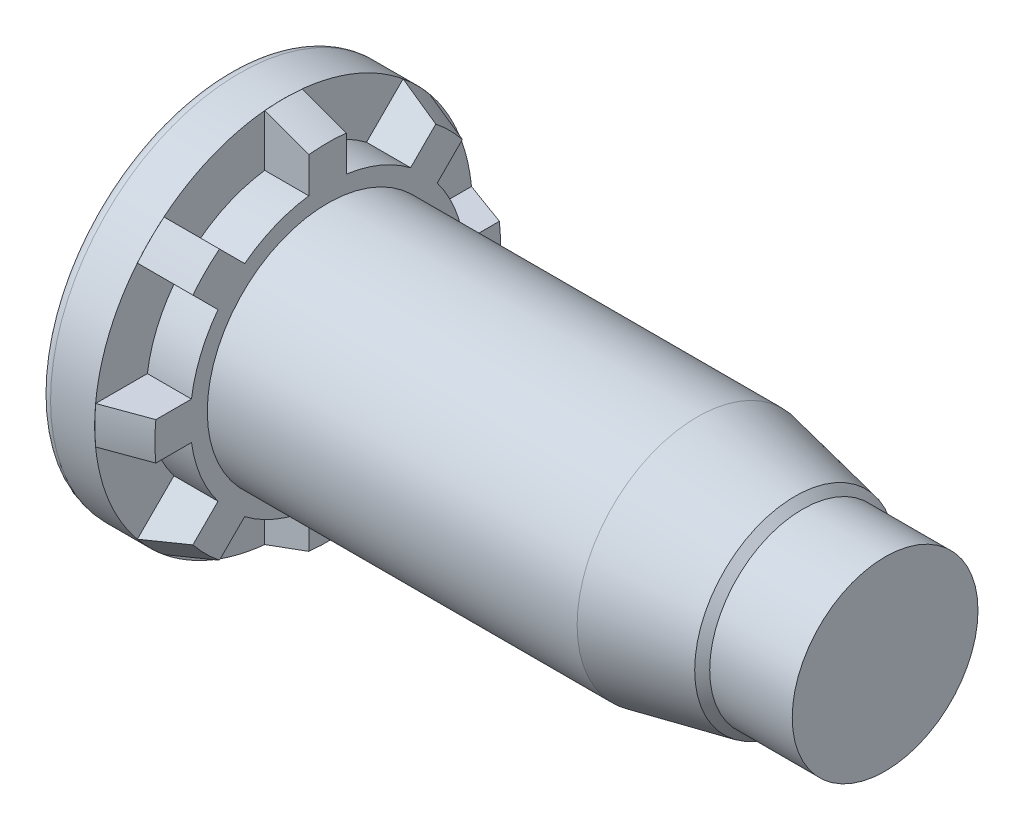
ISO-10303-21;
HEADER;
FILE_DESCRIPTION(('STEP AP214'),'2;1');
FILE_NAME('part.step','',(''),(''),'','','');
FILE_SCHEMA(('AUTOMOTIVE_DESIGN { 1 0 10303 214 1 1 1 1 }'));
ENDSEC;
DATA;
#1=APPLICATION_CONTEXT('core data for automotive mechanical design processes');
#2=APPLICATION_PROTOCOL_DEFINITION('international standard','automotive_design',2000,#1);
#3=PRODUCT_CONTEXT('',#1,'mechanical');
#4=PRODUCT('Part','Part','',(#3));
#5=PRODUCT_RELATED_PRODUCT_CATEGORY('part','',(#4));
#6=PRODUCT_DEFINITION_FORMATION('','',#4);
#7=PRODUCT_DEFINITION_CONTEXT('part definition',#1,'design');
#8=PRODUCT_DEFINITION('design','',#6,#7);
#9=PRODUCT_DEFINITION_SHAPE('','',#8);
#10=(LENGTH_UNIT() NAMED_UNIT(*) SI_UNIT(.MILLI.,.METRE.));
#11=(NAMED_UNIT(*) PLANE_ANGLE_UNIT() SI_UNIT($,.RADIAN.));
#12=(NAMED_UNIT(*) SI_UNIT($,.STERADIAN.) SOLID_ANGLE_UNIT());
#13=UNCERTAINTY_MEASURE_WITH_UNIT(LENGTH_MEASURE(1.E-05),#10,'distance_accuracy_value','');
#14=(GEOMETRIC_REPRESENTATION_CONTEXT(3) GLOBAL_UNCERTAINTY_ASSIGNED_CONTEXT((#13)) GLOBAL_UNIT_ASSIGNED_CONTEXT((#10,
#11,#12)) REPRESENTATION_CONTEXT('',''));
#15=CARTESIAN_POINT('',(0.,0.,0.));
#16=DIRECTION('',(0.,0.,1.));
#17=DIRECTION('',(1.,0.,0.));
#18=AXIS2_PLACEMENT_3D('',#15,#16,#17);
#19=CARTESIAN_POINT('',(0.00254,0.,0.));
#20=DIRECTION('',(-1.,0.,0.));
#21=DIRECTION('',(0.,0.,1.));
#22=AXIS2_PLACEMENT_3D('',#19,#20,#21);
#23=CONICAL_SURFACE('',#22,7.84746,0.349065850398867);
#24=CARTESIAN_POINT('',(1.83219999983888,4.49481180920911,5.60097051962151));
#25=CARTESIAN_POINT('',(1.52724085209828,4.57376577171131,5.67992448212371));
#26=CARTESIAN_POINT('',(1.22227294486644,4.65270280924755,5.75886151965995));
#27=CARTESIAN_POINT('',(0.612319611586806,4.81054303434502,5.91670174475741));
#28=CARTESIAN_POINT('',(0.307334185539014,4.88944622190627,5.99560493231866));
#29=CARTESIAN_POINT('',(0.00233999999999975,4.96833248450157,6.07449119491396));
#30=B_SPLINE_CURVE_WITH_KNOTS('',3,(#24,#25,#26,#27,#28,#29),.UNSPECIFIED.,.F.,.F.,(4,2,4),(0.,
0.974272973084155,1.94854594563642),.UNSPECIFIED.);
#31=CARTESIAN_POINT('',(1.83199999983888,4.49486359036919,5.60102230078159));
#32=VERTEX_POINT('',#31);
#33=CARTESIAN_POINT('',(0.00254,4.9682807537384,6.07443946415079));
#34=VERTEX_POINT('',#33);
#35=EDGE_CURVE('E558',#32,#34,#30,.T.);
#36=ORIENTED_EDGE('',*,*,#35,.F.);
#37=CARTESIAN_POINT('',(1.832,0.,0.));
#38=DIRECTION('',(-1.,0.,0.));
#39=DIRECTION('',(0.,0.,1.));
#40=AXIS2_PLACEMENT_3D('',#37,#38,#39);
#41=CIRCLE('',#40,7.18159101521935);
#42=CARTESIAN_POINT('',(1.83199999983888,5.60102230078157,4.49486359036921));
#43=VERTEX_POINT('',#42);
#44=EDGE_CURVE('E561',#32,#43,#41,.T.);
#45=ORIENTED_EDGE('',*,*,#44,.T.);
#46=CARTESIAN_POINT('',(0.00233999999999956,6.07449119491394,4.96833248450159));
#47=CARTESIAN_POINT('',(0.307334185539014,5.99560493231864,4.88944622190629));
#48=CARTESIAN_POINT('',(0.612319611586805,5.9167017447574,4.81054303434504));
#49=CARTESIAN_POINT('',(1.22227294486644,5.75886151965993,4.65270280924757));
#50=CARTESIAN_POINT('',(1.52724085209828,5.67992448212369,4.57376577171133));
#51=CARTESIAN_POINT('',(1.83219999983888,5.60097051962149,4.49481180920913));
#52=B_SPLINE_CURVE_WITH_KNOTS('',3,(#46,#47,#48,#49,#50,#51),.UNSPECIFIED.,.F.,.F.,(4,2,4),(0.,
0.974272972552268,1.94854594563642),.UNSPECIFIED.);
#53=CARTESIAN_POINT('',(0.00254,6.07443946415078,4.96828075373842));
#54=VERTEX_POINT('',#53);
#55=EDGE_CURVE('E453',#54,#43,#52,.T.);
#56=ORIENTED_EDGE('',*,*,#55,.F.);
#57=CARTESIAN_POINT('',(0.00254,0.,0.));
#58=DIRECTION('',(-1.,0.,0.));
#59=DIRECTION('',(0.,0.,1.));
#60=AXIS2_PLACEMENT_3D('',#57,#58,#59);
#61=CIRCLE('',#60,7.84746);
#62=EDGE_CURVE('E563',#34,#54,#61,.T.);
#63=ORIENTED_EDGE('',*,*,#62,.F.);
#64=EDGE_LOOP('',(#36,#45,#56,#63));
#65=FACE_BOUND('',#64,.T.);
#66=ADVANCED_FACE('F33',(#65),#23,.T.);
#67=CARTESIAN_POINT('',(1.83219999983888,-5.60097051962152,4.49481180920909));
#68=CARTESIAN_POINT('',(1.52724085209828,-5.67992448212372,4.57376577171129));
#69=CARTESIAN_POINT('',(1.22227294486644,-5.75886151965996,4.65270280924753));
#70=CARTESIAN_POINT('',(0.612319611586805,-5.91670174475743,4.810543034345));
#71=CARTESIAN_POINT('',(0.307334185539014,-5.99560493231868,4.88944622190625));
#72=CARTESIAN_POINT('',(0.00234,-6.07449119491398,4.96833248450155));
#73=B_SPLINE_CURVE_WITH_KNOTS('',3,(#67,#68,#69,#70,#71,#72),.UNSPECIFIED.,.F.,.F.,(4,2,4),(0.,
0.974272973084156,1.94854594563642),.UNSPECIFIED.);
#74=CARTESIAN_POINT('',(1.83199999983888,-5.6010223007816,4.49486359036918));
#75=VERTEX_POINT('',#74);
#76=CARTESIAN_POINT('',(0.00254,-6.07443946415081,4.96828075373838));
#77=VERTEX_POINT('',#76);
#78=EDGE_CURVE('E611',#75,#77,#73,.T.);
#79=ORIENTED_EDGE('',*,*,#78,.F.);
#80=CARTESIAN_POINT('',(1.83199999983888,-4.49486359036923,5.60102230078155));
#81=VERTEX_POINT('',#80);
#82=EDGE_CURVE('E575',#75,#81,#41,.T.);
#83=ORIENTED_EDGE('',*,*,#82,.T.);
#84=CARTESIAN_POINT('',(0.00233999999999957,-4.96833248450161,6.07449119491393));
#85=CARTESIAN_POINT('',(0.307334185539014,-4.88944622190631,5.99560493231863));
#86=CARTESIAN_POINT('',(0.612319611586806,-4.81054303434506,5.91670174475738));
#87=CARTESIAN_POINT('',(1.22227294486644,-4.65270280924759,5.75886151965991));
#88=CARTESIAN_POINT('',(1.52724085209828,-4.57376577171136,5.67992448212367));
#89=CARTESIAN_POINT('',(1.83219999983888,-4.49481180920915,5.60097051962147));
#90=B_SPLINE_CURVE_WITH_KNOTS('',3,(#84,#85,#86,#87,#88,#89),.UNSPECIFIED.,.F.,.F.,(4,2,4),(0.,
0.974272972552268,1.94854594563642),.UNSPECIFIED.);
#91=CARTESIAN_POINT('',(0.00254,-4.96828075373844,6.07443946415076));
#92=VERTEX_POINT('',#91);
#93=EDGE_CURVE('E609',#92,#81,#90,.T.);
#94=ORIENTED_EDGE('',*,*,#93,.F.);
#95=EDGE_CURVE('E761',#77,#92,#61,.T.);
#96=ORIENTED_EDGE('',*,*,#95,.F.);
#97=EDGE_LOOP('',(#79,#83,#94,#96));
#98=FACE_BOUND('',#97,.T.);
#99=ADVANCED_FACE('F549',(#98),#23,.T.);
#100=CARTESIAN_POINT('',(-4.64587386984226,0.782172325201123,9.50722335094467));
#101=CARTESIAN_POINT('',(-3.82311628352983,0.782172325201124,9.20674777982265));
#102=CARTESIAN_POINT('',(-3.00038658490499,0.782172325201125,8.90619580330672));
#103=CARTESIAN_POINT('',(-1.35501150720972,0.782172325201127,8.30486157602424));
#104=CARTESIAN_POINT('',(-0.532366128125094,0.782172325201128,8.00407932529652));
#105=CARTESIAN_POINT('',(1.11281213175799,0.78217232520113,7.4022069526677));
#106=CARTESIAN_POINT('',(1.93534501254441,0.782172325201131,7.10111683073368));
#107=CARTESIAN_POINT('',(3.58023889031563,0.782172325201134,6.49846704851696));
#108=CARTESIAN_POINT('',(4.4025998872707,0.782172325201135,6.19690738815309));
#109=CARTESIAN_POINT('',(5.22484515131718,0.782172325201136,5.89503216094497));
#110=B_SPLINE_CURVE_WITH_KNOTS('',3,(#100,#101,#102,#103,#104,#105,#106,#107,#108,#109),
.UNSPECIFIED.,.F.,.F.,(4,2,2,2,4),(0.,2.62772536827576,5.25545029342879,7.88317549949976,
10.510901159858),.UNSPECIFIED.);
#111=CARTESIAN_POINT('',(0.00254,0.782172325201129,7.80838234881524));
#112=VERTEX_POINT('',#111);
#113=CARTESIAN_POINT('',(1.83199999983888,0.782172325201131,7.13886937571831));
#114=VERTEX_POINT('',#113);
#115=EDGE_CURVE('E566',#112,#114,#110,.T.);
#116=ORIENTED_EDGE('',*,*,#115,.F.);
#117=CARTESIAN_POINT('',(0.00254,-0.782172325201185,7.80838234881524));
#118=VERTEX_POINT('',#117);
#119=EDGE_CURVE('E690',#118,#112,#61,.T.);
#120=ORIENTED_EDGE('',*,*,#119,.F.);
#121=CARTESIAN_POINT('',(5.22484515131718,-0.782172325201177,5.89503216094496));
#122=CARTESIAN_POINT('',(4.4025998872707,-0.782172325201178,6.19690738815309));
#123=CARTESIAN_POINT('',(3.58023889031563,-0.78217232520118,6.49846704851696));
#124=CARTESIAN_POINT('',(1.93534501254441,-0.782172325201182,7.10111683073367));
#125=CARTESIAN_POINT('',(1.11281213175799,-0.782172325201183,7.40220695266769));
#126=CARTESIAN_POINT('',(-0.532366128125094,-0.782172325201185,8.00407932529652));
#127=CARTESIAN_POINT('',(-1.35501150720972,-0.782172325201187,8.30486157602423));
#128=CARTESIAN_POINT('',(-3.00038658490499,-0.782172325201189,8.90619580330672));
#129=CARTESIAN_POINT('',(-3.82311628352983,-0.78217232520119,9.20674777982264));
#130=CARTESIAN_POINT('',(-4.64587386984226,-0.782172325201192,9.50722335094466));
#131=B_SPLINE_CURVE_WITH_KNOTS('',3,(#121,#122,#123,#124,#125,#126,#127,#128,#129,#130),
.UNSPECIFIED.,.F.,.F.,(4,2,2,2,4),(0.,2.62772566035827,5.25545086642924,7.88317579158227,
10.510901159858),.UNSPECIFIED.);
#132=CARTESIAN_POINT('',(1.83199999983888,-0.782172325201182,7.13886937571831));
#133=VERTEX_POINT('',#132);
#134=EDGE_CURVE('E629',#133,#118,#131,.T.);
#135=ORIENTED_EDGE('',*,*,#134,.F.);
#136=EDGE_CURVE('E570',#133,#114,#41,.T.);
#137=ORIENTED_EDGE('',*,*,#136,.T.);
#138=EDGE_LOOP('',(#116,#120,#135,#137));
#139=FACE_BOUND('',#138,.T.);
#140=ADVANCED_FACE('F554',(#139),#23,.T.);
#141=CARTESIAN_POINT('',(5.22484515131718,0.782172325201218,-5.89503216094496));
#142=CARTESIAN_POINT('',(4.4025998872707,0.782172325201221,-6.19690738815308));
#143=CARTESIAN_POINT('',(3.58023889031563,0.782172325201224,-6.49846704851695));
#144=CARTESIAN_POINT('',(1.93534501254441,0.782172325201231,-7.10111683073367));
#145=CARTESIAN_POINT('',(1.11281213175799,0.782172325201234,-7.40220695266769));
#146=CARTESIAN_POINT('',(-0.532366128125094,0.782172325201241,-8.00407932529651));
#147=CARTESIAN_POINT('',(-1.35501150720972,0.782172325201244,-8.30486157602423));
#148=CARTESIAN_POINT('',(-3.00038658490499,0.78217232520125,-8.90619580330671));
#149=CARTESIAN_POINT('',(-3.82311628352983,0.782172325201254,-9.20674777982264));
#150=CARTESIAN_POINT('',(-4.64587386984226,0.782172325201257,-9.50722335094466));
#151=B_SPLINE_CURVE_WITH_KNOTS('',3,(#141,#142,#143,#144,#145,#146,#147,#148,#149,#150),
.UNSPECIFIED.,.F.,.F.,(4,2,2,2,4),(0.,2.62772566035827,5.25545086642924,7.88317579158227,
10.510901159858),.UNSPECIFIED.);
#152=CARTESIAN_POINT('',(1.83199999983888,0.782172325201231,-7.1388693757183));
#153=VERTEX_POINT('',#152);
#154=CARTESIAN_POINT('',(0.00254,0.782172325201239,-7.80838234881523));
#155=VERTEX_POINT('',#154);
#156=EDGE_CURVE('E705',#153,#155,#151,.T.);
#157=ORIENTED_EDGE('',*,*,#156,.F.);
#158=CARTESIAN_POINT('',(1.83199999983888,-0.782172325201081,-7.13886937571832));
#159=VERTEX_POINT('',#158);
#160=EDGE_CURVE('E577',#153,#159,#41,.T.);
#161=ORIENTED_EDGE('',*,*,#160,.T.);
#162=CARTESIAN_POINT('',(-4.64587386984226,-0.782172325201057,-9.50722335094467));
#163=CARTESIAN_POINT('',(-3.82311628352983,-0.78217232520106,-9.20674777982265));
#164=CARTESIAN_POINT('',(-3.00038658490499,-0.782172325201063,-8.90619580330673));
#165=CARTESIAN_POINT('',(-1.35501150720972,-0.782172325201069,-8.30486157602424));
#166=CARTESIAN_POINT('',(-0.532366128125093,-0.782172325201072,-8.00407932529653));
#167=CARTESIAN_POINT('',(1.11281213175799,-0.782172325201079,-7.4022069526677));
#168=CARTESIAN_POINT('',(1.93534501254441,-0.782172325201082,-7.10111683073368));
#169=CARTESIAN_POINT('',(3.58023889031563,-0.782172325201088,-6.49846704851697));
#170=CARTESIAN_POINT('',(4.4025998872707,-0.782172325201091,-6.1969073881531));
#171=CARTESIAN_POINT('',(5.22484515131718,-0.782172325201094,-5.89503216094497));
#172=B_SPLINE_CURVE_WITH_KNOTS('',3,(#162,#163,#164,#165,#166,#167,#168,#169,#170,#171),
.UNSPECIFIED.,.F.,.F.,(4,2,2,2,4),(0.,2.62772536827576,5.25545029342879,7.88317549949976,
10.510901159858),.UNSPECIFIED.);
#173=CARTESIAN_POINT('',(0.00254,-0.782172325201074,-7.80838234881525));
#174=VERTEX_POINT('',#173);
#175=EDGE_CURVE('E709',#174,#159,#172,.T.);
#176=ORIENTED_EDGE('',*,*,#175,.F.);
#177=EDGE_CURVE('E683',#155,#174,#61,.T.);
#178=ORIENTED_EDGE('',*,*,#177,.F.);
#179=EDGE_LOOP('',(#157,#161,#176,#178));
#180=FACE_BOUND('',#179,.T.);
#181=ADVANCED_FACE('F944',(#180),#23,.T.);
#182=CARTESIAN_POINT('',(1.83219999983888,-4.49481180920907,-5.60097051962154));
#183=CARTESIAN_POINT('',(1.52724085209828,-4.57376577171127,-5.67992448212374));
#184=CARTESIAN_POINT('',(1.22227294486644,-4.65270280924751,-5.75886151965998));
#185=CARTESIAN_POINT('',(0.612319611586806,-4.81054303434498,-5.91670174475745));
#186=CARTESIAN_POINT('',(0.307334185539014,-4.88944622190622,-5.9956049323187));
#187=CARTESIAN_POINT('',(0.00234,-4.96833248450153,-6.074491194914));
#188=B_SPLINE_CURVE_WITH_KNOTS('',3,(#182,#183,#184,#185,#186,#187),.UNSPECIFIED.,.F.,.F.,(4,2,
4),(0.,0.974272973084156,1.94854594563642),.UNSPECIFIED.);
#189=CARTESIAN_POINT('',(1.83199999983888,-4.49486359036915,-5.60102230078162));
#190=VERTEX_POINT('',#189);
#191=CARTESIAN_POINT('',(0.00254,-4.96828075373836,-6.07443946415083));
#192=VERTEX_POINT('',#191);
#193=EDGE_CURVE('E706',#190,#192,#188,.T.);
#194=ORIENTED_EDGE('',*,*,#193,.F.);
#195=CARTESIAN_POINT('',(1.83199999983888,-5.60102230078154,-4.49486359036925));
#196=VERTEX_POINT('',#195);
#197=EDGE_CURVE('E588',#190,#196,#41,.T.);
#198=ORIENTED_EDGE('',*,*,#197,.T.);
#199=CARTESIAN_POINT('',(0.00234000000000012,-6.07449119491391,-4.96833248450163));
#200=CARTESIAN_POINT('',(0.307334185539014,-5.99560493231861,-4.88944622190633));
#201=CARTESIAN_POINT('',(0.612319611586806,-5.91670174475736,-4.81054303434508));
#202=CARTESIAN_POINT('',(1.22227294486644,-5.7588615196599,-4.65270280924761));
#203=CARTESIAN_POINT('',(1.52724085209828,-5.67992448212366,-4.57376577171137));
#204=CARTESIAN_POINT('',(1.83219999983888,-5.60097051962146,-4.49481180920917));
#205=B_SPLINE_CURVE_WITH_KNOTS('',3,(#199,#200,#201,#202,#203,#204),.UNSPECIFIED.,.F.,.F.,(4,2,
4),(0.,0.974272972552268,1.94854594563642),.UNSPECIFIED.);
#206=CARTESIAN_POINT('',(0.00254,-6.07443946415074,-4.96828075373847));
#207=VERTEX_POINT('',#206);
#208=EDGE_CURVE('E321',#207,#196,#205,.T.);
#209=ORIENTED_EDGE('',*,*,#208,.F.);
#210=EDGE_CURVE('E689',#192,#207,#61,.T.);
#211=ORIENTED_EDGE('',*,*,#210,.F.);
#212=EDGE_LOOP('',(#194,#198,#209,#211));
#213=FACE_BOUND('',#212,.T.);
#214=ADVANCED_FACE('F941',(#213),#23,.T.);
#215=CARTESIAN_POINT('',(-4.64587386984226,-9.50722335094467,0.78217232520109));
#216=CARTESIAN_POINT('',(-3.82311628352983,-9.20674777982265,0.782172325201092));
#217=CARTESIAN_POINT('',(-3.00038658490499,-8.90619580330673,0.782172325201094));
#218=CARTESIAN_POINT('',(-1.35501150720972,-8.30486157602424,0.782172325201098));
#219=CARTESIAN_POINT('',(-0.532366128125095,-8.00407932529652,0.7821723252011));
#220=CARTESIAN_POINT('',(1.11281213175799,-7.4022069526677,0.782172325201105));
#221=CARTESIAN_POINT('',(1.93534501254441,-7.10111683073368,0.782172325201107));
#222=CARTESIAN_POINT('',(3.58023889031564,-6.49846704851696,0.782172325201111));
#223=CARTESIAN_POINT('',(4.4025998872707,-6.1969073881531,0.782172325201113));
#224=CARTESIAN_POINT('',(5.22484515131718,-5.89503216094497,0.782172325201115));
#225=B_SPLINE_CURVE_WITH_KNOTS('',3,(#215,#216,#217,#218,#219,#220,#221,#222,#223,#224),
.UNSPECIFIED.,.F.,.F.,(4,2,2,2,4),(0.,2.62772536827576,5.25545029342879,7.88317549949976,
10.510901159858),.UNSPECIFIED.);
#226=CARTESIAN_POINT('',(0.00254,-7.80838234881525,0.782172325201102));
#227=VERTEX_POINT('',#226);
#228=CARTESIAN_POINT('',(1.83199999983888,-7.13886937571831,0.782172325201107));
#229=VERTEX_POINT('',#228);
#230=EDGE_CURVE('E760',#227,#229,#225,.T.);
#231=ORIENTED_EDGE('',*,*,#230,.F.);
#232=CARTESIAN_POINT('',(0.00254,-7.80838234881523,-0.782172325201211));
#233=VERTEX_POINT('',#232);
#234=EDGE_CURVE('E754',#233,#227,#61,.T.);
#235=ORIENTED_EDGE('',*,*,#234,.F.);
#236=CARTESIAN_POINT('',(5.22484515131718,-5.89503216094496,-0.782172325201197));
#237=CARTESIAN_POINT('',(4.4025998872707,-6.19690738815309,-0.782172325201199));
#238=CARTESIAN_POINT('',(3.58023889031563,-6.49846704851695,-0.782172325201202));
#239=CARTESIAN_POINT('',(1.93534501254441,-7.10111683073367,-0.782172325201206));
#240=CARTESIAN_POINT('',(1.11281213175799,-7.40220695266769,-0.782172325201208));
#241=CARTESIAN_POINT('',(-0.532366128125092,-8.00407932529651,-0.782172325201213));
#242=CARTESIAN_POINT('',(-1.35501150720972,-8.30486157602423,-0.782172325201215));
#243=CARTESIAN_POINT('',(-3.00038658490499,-8.90619580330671,-0.78217232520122));
#244=CARTESIAN_POINT('',(-3.82311628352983,-9.20674777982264,-0.782172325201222));
#245=CARTESIAN_POINT('',(-4.64587386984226,-9.50722335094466,-0.782172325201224));
#246=B_SPLINE_CURVE_WITH_KNOTS('',3,(#236,#237,#238,#239,#240,#241,#242,#243,#244,#245),
.UNSPECIFIED.,.F.,.F.,(4,2,2,2,4),(0.,2.62772566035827,5.25545086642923,7.88317579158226,
10.510901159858),.UNSPECIFIED.);
#247=CARTESIAN_POINT('',(1.83199999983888,-7.1388693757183,-0.782172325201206));
#248=VERTEX_POINT('',#247);
#249=EDGE_CURVE('E421',#248,#233,#246,.T.);
#250=ORIENTED_EDGE('',*,*,#249,.F.);
#251=EDGE_CURVE('E594',#248,#229,#41,.T.);
#252=ORIENTED_EDGE('',*,*,#251,.T.);
#253=EDGE_LOOP('',(#231,#235,#250,#252));
#254=FACE_BOUND('',#253,.T.);
#255=ADVANCED_FACE('F759',(#254),#23,.T.);
#256=CARTESIAN_POINT('',(0.,0.,0.));
#257=DIRECTION('',(-1.,0.,0.));
#258=DIRECTION('',(0.,0.,1.));
#259=AXIS2_PLACEMENT_3D('',#256,#257,#258);
#260=CYLINDRICAL_SURFACE('',#259,7.84746);
#261=CARTESIAN_POINT('',(0.,0.,0.));
#262=DIRECTION('',(-1.,0.,0.));
#263=DIRECTION('',(0.,0.,1.));
#264=AXIS2_PLACEMENT_3D('',#261,#262,#263);
#265=CIRCLE('',#264,7.84746);
#266=CARTESIAN_POINT('',(0.,4.9682807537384,6.07443946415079));
#267=VERTEX_POINT('',#266);
#268=CARTESIAN_POINT('',(-1.61121766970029E-10,6.07443946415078,4.96828075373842));
#269=VERTEX_POINT('',#268);
#270=EDGE_CURVE('E638',#267,#269,#265,.T.);
#271=ORIENTED_EDGE('',*,*,#270,.F.);
#272=DIRECTION('',(-1.,0.,0.));
#273=VECTOR('',#272,1.);
#274=CARTESIAN_POINT('',(0.,4.9682807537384,6.07443946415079));
#275=LINE('',#274,#273);
#276=EDGE_CURVE('E11',#267,#34,#275,.F.);
#277=ORIENTED_EDGE('',*,*,#276,.T.);
#278=ORIENTED_EDGE('',*,*,#62,.T.);
#279=DIRECTION('',(-1.,0.,0.));
#280=VECTOR('',#279,1.);
#281=CARTESIAN_POINT('',(0.,6.07443946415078,4.96828075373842));
#282=LINE('',#281,#280);
#283=EDGE_CURVE('E700',#54,#269,#282,.T.);
#284=ORIENTED_EDGE('',*,*,#283,.T.);
#285=EDGE_LOOP('',(#271,#277,#278,#284));
#286=FACE_BOUND('',#285,.T.);
#287=ADVANCED_FACE('F503',(#286),#260,.T.);
#288=CARTESIAN_POINT('',(0.,-6.07443946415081,4.96828075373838));
#289=VERTEX_POINT('',#288);
#290=CARTESIAN_POINT('',(-1.61121766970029E-10,-4.96828075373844,6.07443946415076));
#291=VERTEX_POINT('',#290);
#292=EDGE_CURVE('E637',#289,#291,#265,.T.);
#293=ORIENTED_EDGE('',*,*,#292,.F.);
#294=DIRECTION('',(-1.,0.,0.));
#295=VECTOR('',#294,1.);
#296=CARTESIAN_POINT('',(0.,-6.07443946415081,4.96828075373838));
#297=LINE('',#296,#295);
#298=EDGE_CURVE('E871',#289,#77,#297,.F.);
#299=ORIENTED_EDGE('',*,*,#298,.T.);
#300=ORIENTED_EDGE('',*,*,#95,.T.);
#301=DIRECTION('',(-1.,0.,0.));
#302=VECTOR('',#301,1.);
#303=CARTESIAN_POINT('',(0.,-4.96828075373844,6.07443946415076));
#304=LINE('',#303,#302);
#305=EDGE_CURVE('E634',#92,#291,#304,.T.);
#306=ORIENTED_EDGE('',*,*,#305,.T.);
#307=EDGE_LOOP('',(#293,#299,#300,#306));
#308=FACE_BOUND('',#307,.T.);
#309=ADVANCED_FACE('F874',(#308),#260,.T.);
#310=ORIENTED_EDGE('',*,*,#119,.T.);
#311=DIRECTION('',(-1.,0.,0.));
#312=VECTOR('',#311,1.);
#313=CARTESIAN_POINT('',(0.,0.782172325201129,7.80838234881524));
#314=LINE('',#313,#312);
#315=CARTESIAN_POINT('',(-1.61121766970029E-10,0.782172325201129,7.80838234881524));
#316=VERTEX_POINT('',#315);
#317=EDGE_CURVE('E42',#112,#316,#314,.T.);
#318=ORIENTED_EDGE('',*,*,#317,.T.);
#319=CARTESIAN_POINT('',(0.,-0.782172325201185,7.80838234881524));
#320=VERTEX_POINT('',#319);
#321=EDGE_CURVE('E297',#320,#316,#265,.T.);
#322=ORIENTED_EDGE('',*,*,#321,.F.);
#323=DIRECTION('',(-1.,0.,0.));
#324=VECTOR('',#323,1.);
#325=CARTESIAN_POINT('',(0.,-0.782172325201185,7.80838234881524));
#326=LINE('',#325,#324);
#327=EDGE_CURVE('E627',#320,#118,#326,.F.);
#328=ORIENTED_EDGE('',*,*,#327,.T.);
#329=EDGE_LOOP('',(#310,#318,#322,#328));
#330=FACE_BOUND('',#329,.T.);
#331=ADVANCED_FACE('F636',(#330),#260,.T.);
#332=CARTESIAN_POINT('',(0.,0.782172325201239,-7.80838234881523));
#333=VERTEX_POINT('',#332);
#334=CARTESIAN_POINT('',(-1.61121766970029E-10,-0.782172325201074,-7.80838234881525));
#335=VERTEX_POINT('',#334);
#336=EDGE_CURVE('E646',#333,#335,#265,.T.);
#337=ORIENTED_EDGE('',*,*,#336,.F.);
#338=DIRECTION('',(-1.,0.,0.));
#339=VECTOR('',#338,1.);
#340=CARTESIAN_POINT('',(0.,0.782172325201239,-7.80838234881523));
#341=LINE('',#340,#339);
#342=EDGE_CURVE('E875',#333,#155,#341,.F.);
#343=ORIENTED_EDGE('',*,*,#342,.T.);
#344=ORIENTED_EDGE('',*,*,#177,.T.);
#345=DIRECTION('',(-1.,0.,0.));
#346=VECTOR('',#345,1.);
#347=CARTESIAN_POINT('',(0.,-0.782172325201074,-7.80838234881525));
#348=LINE('',#347,#346);
#349=EDGE_CURVE('E756',#174,#335,#348,.T.);
#350=ORIENTED_EDGE('',*,*,#349,.T.);
#351=EDGE_LOOP('',(#337,#343,#344,#350));
#352=FACE_BOUND('',#351,.T.);
#353=ADVANCED_FACE('F853',(#352),#260,.T.);
#354=CARTESIAN_POINT('',(0.,-4.96828075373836,-6.07443946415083));
#355=VERTEX_POINT('',#354);
#356=CARTESIAN_POINT('',(-1.61121766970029E-10,-6.07443946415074,-4.96828075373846));
#357=VERTEX_POINT('',#356);
#358=EDGE_CURVE('E859',#355,#357,#265,.T.);
#359=ORIENTED_EDGE('',*,*,#358,.F.);
#360=DIRECTION('',(-1.,0.,0.));
#361=VECTOR('',#360,1.);
#362=CARTESIAN_POINT('',(0.,-4.96828075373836,-6.07443946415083));
#363=LINE('',#362,#361);
#364=EDGE_CURVE('E855',#355,#192,#363,.F.);
#365=ORIENTED_EDGE('',*,*,#364,.T.);
#366=ORIENTED_EDGE('',*,*,#210,.T.);
#367=DIRECTION('',(-1.,0.,0.));
#368=VECTOR('',#367,1.);
#369=CARTESIAN_POINT('',(0.,-6.07443946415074,-4.96828075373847));
#370=LINE('',#369,#368);
#371=EDGE_CURVE('E757',#207,#357,#370,.T.);
#372=ORIENTED_EDGE('',*,*,#371,.T.);
#373=EDGE_LOOP('',(#359,#365,#366,#372));
#374=FACE_BOUND('',#373,.T.);
#375=ADVANCED_FACE('F931',(#374),#260,.T.);
#376=ORIENTED_EDGE('',*,*,#234,.T.);
#377=DIRECTION('',(-1.,0.,0.));
#378=VECTOR('',#377,1.);
#379=CARTESIAN_POINT('',(0.,-7.80838234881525,0.782172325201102));
#380=LINE('',#379,#378);
#381=CARTESIAN_POINT('',(-1.61121766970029E-10,-7.80838234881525,0.782172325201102));
#382=VERTEX_POINT('',#381);
#383=EDGE_CURVE('E633',#227,#382,#380,.T.);
#384=ORIENTED_EDGE('',*,*,#383,.T.);
#385=CARTESIAN_POINT('',(0.,-7.80838234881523,-0.782172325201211));
#386=VERTEX_POINT('',#385);
#387=EDGE_CURVE('E640',#386,#382,#265,.T.);
#388=ORIENTED_EDGE('',*,*,#387,.F.);
#389=DIRECTION('',(-1.,0.,0.));
#390=VECTOR('',#389,1.);
#391=CARTESIAN_POINT('',(0.,-7.80838234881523,-0.782172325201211));
#392=LINE('',#391,#390);
#393=EDGE_CURVE('E746',#386,#233,#392,.F.);
#394=ORIENTED_EDGE('',*,*,#393,.T.);
#395=EDGE_LOOP('',(#376,#384,#388,#394));
#396=FACE_BOUND('',#395,.T.);
#397=ADVANCED_FACE('F752',(#396),#260,.T.);
#398=CARTESIAN_POINT('',(5.22484515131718,5.89503216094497,0.782172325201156));
#399=CARTESIAN_POINT('',(4.4025998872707,6.19690738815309,0.782172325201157));
#400=CARTESIAN_POINT('',(3.58023889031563,6.49846704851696,0.782172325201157));
#401=CARTESIAN_POINT('',(1.93534501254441,7.10111683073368,0.782172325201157));
#402=CARTESIAN_POINT('',(1.11281213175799,7.40220695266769,0.782172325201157));
#403=CARTESIAN_POINT('',(-0.532366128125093,8.00407932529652,0.782172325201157));
#404=CARTESIAN_POINT('',(-1.35501150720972,8.30486157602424,0.782172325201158));
#405=CARTESIAN_POINT('',(-3.00038658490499,8.90619580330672,0.782172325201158));
#406=CARTESIAN_POINT('',(-3.82311628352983,9.20674777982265,0.782172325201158));
#407=CARTESIAN_POINT('',(-4.64587386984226,9.50722335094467,0.782172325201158));
#408=B_SPLINE_CURVE_WITH_KNOTS('',3,(#398,#399,#400,#401,#402,#403,#404,#405,#406,#407),
.UNSPECIFIED.,.F.,.F.,(4,2,2,2,4),(0.,2.62772566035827,5.25545086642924,7.88317579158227,
10.510901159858),.UNSPECIFIED.);
#409=CARTESIAN_POINT('',(1.83199999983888,7.13886937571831,0.782172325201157));
#410=VERTEX_POINT('',#409);
#411=CARTESIAN_POINT('',(0.00254,7.80838234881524,0.782172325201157));
#412=VERTEX_POINT('',#411);
#413=EDGE_CURVE('E445',#410,#412,#408,.T.);
#414=ORIENTED_EDGE('',*,*,#413,.F.);
#415=CARTESIAN_POINT('',(1.83199999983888,7.13886937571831,-0.782172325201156));
#416=VERTEX_POINT('',#415);
#417=EDGE_CURVE('E571',#410,#416,#41,.T.);
#418=ORIENTED_EDGE('',*,*,#417,.T.);
#419=CARTESIAN_POINT('',(-4.64587386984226,9.50722335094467,-0.782172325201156));
#420=CARTESIAN_POINT('',(-3.82311628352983,9.20674777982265,-0.782172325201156));
#421=CARTESIAN_POINT('',(-3.00038658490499,8.90619580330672,-0.782172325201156));
#422=CARTESIAN_POINT('',(-1.35501150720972,8.30486157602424,-0.782172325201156));
#423=CARTESIAN_POINT('',(-0.532366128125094,8.00407932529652,-0.782172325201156));
#424=CARTESIAN_POINT('',(1.11281213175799,7.40220695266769,-0.782172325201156));
#425=CARTESIAN_POINT('',(1.93534501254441,7.10111683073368,-0.782172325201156));
#426=CARTESIAN_POINT('',(3.58023889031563,6.49846704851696,-0.782172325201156));
#427=CARTESIAN_POINT('',(4.4025998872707,6.19690738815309,-0.782172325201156));
#428=CARTESIAN_POINT('',(5.22484515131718,5.89503216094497,-0.782172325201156));
#429=B_SPLINE_CURVE_WITH_KNOTS('',3,(#419,#420,#421,#422,#423,#424,#425,#426,#427,#428),
.UNSPECIFIED.,.F.,.F.,(4,2,2,2,4),(0.,2.62772536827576,5.25545029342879,7.88317549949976,
10.510901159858),.UNSPECIFIED.);
#430=CARTESIAN_POINT('',(0.00254,7.80838234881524,-0.782172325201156));
#431=VERTEX_POINT('',#430);
#432=EDGE_CURVE('E475',#431,#416,#429,.T.);
#433=ORIENTED_EDGE('',*,*,#432,.F.);
#434=EDGE_CURVE('E684',#412,#431,#61,.T.);
#435=ORIENTED_EDGE('',*,*,#434,.F.);
#436=EDGE_LOOP('',(#414,#418,#433,#435));
#437=FACE_BOUND('',#436,.T.);
#438=ADVANCED_FACE('F545',(#437),#23,.T.);
#439=CARTESIAN_POINT('',(0.,7.80838234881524,0.782172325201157));
#440=VERTEX_POINT('',#439);
#441=CARTESIAN_POINT('',(-1.61121766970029E-10,7.80838234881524,-0.782172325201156));
#442=VERTEX_POINT('',#441);
#443=EDGE_CURVE('E641',#440,#442,#265,.T.);
#444=ORIENTED_EDGE('',*,*,#443,.F.);
#445=DIRECTION('',(-1.,0.,0.));
#446=VECTOR('',#445,1.);
#447=CARTESIAN_POINT('',(0.,7.80838234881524,0.782172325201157));
#448=LINE('',#447,#446);
#449=EDGE_CURVE('E886',#440,#412,#448,.F.);
#450=ORIENTED_EDGE('',*,*,#449,.T.);
#451=ORIENTED_EDGE('',*,*,#434,.T.);
#452=DIRECTION('',(-1.,0.,0.));
#453=VECTOR('',#452,1.);
#454=CARTESIAN_POINT('',(0.,7.80838234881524,-0.782172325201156));
#455=LINE('',#454,#453);
#456=EDGE_CURVE('E581',#431,#442,#455,.T.);
#457=ORIENTED_EDGE('',*,*,#456,.T.);
#458=EDGE_LOOP('',(#444,#450,#451,#457));
#459=FACE_BOUND('',#458,.T.);
#460=ADVANCED_FACE('F504',(#459),#260,.T.);
#461=CARTESIAN_POINT('',(0.00233999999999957,4.96833248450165,-6.07449119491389));
#462=CARTESIAN_POINT('',(0.307334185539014,4.88944622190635,-5.99560493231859));
#463=CARTESIAN_POINT('',(0.612319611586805,4.8105430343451,-5.91670174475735));
#464=CARTESIAN_POINT('',(1.22227294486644,4.65270280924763,-5.75886151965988));
#465=CARTESIAN_POINT('',(1.52724085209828,4.57376577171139,-5.67992448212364));
#466=CARTESIAN_POINT('',(1.83219999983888,4.49481180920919,-5.60097051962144));
#467=B_SPLINE_CURVE_WITH_KNOTS('',3,(#461,#462,#463,#464,#465,#466),.UNSPECIFIED.,.F.,.F.,(4,2,
4),(0.,0.974272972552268,1.94854594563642),.UNSPECIFIED.);
#468=CARTESIAN_POINT('',(0.00254,4.96828075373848,-6.07443946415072));
#469=VERTEX_POINT('',#468);
#470=CARTESIAN_POINT('',(1.83199999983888,4.49486359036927,-5.60102230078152));
#471=VERTEX_POINT('',#470);
#472=EDGE_CURVE('E702',#469,#471,#467,.T.);
#473=ORIENTED_EDGE('',*,*,#472,.F.);
#474=CARTESIAN_POINT('',(0.00254,6.07443946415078,-4.96828075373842));
#475=VERTEX_POINT('',#474);
#476=EDGE_CURVE('E647',#475,#469,#61,.T.);
#477=ORIENTED_EDGE('',*,*,#476,.F.);
#478=CARTESIAN_POINT('',(1.83219999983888,5.60097051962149,-4.49481180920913));
#479=CARTESIAN_POINT('',(1.52724085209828,5.67992448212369,-4.57376577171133));
#480=CARTESIAN_POINT('',(1.22227294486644,5.75886151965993,-4.65270280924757));
#481=CARTESIAN_POINT('',(0.612319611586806,5.9167017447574,-4.81054303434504));
#482=CARTESIAN_POINT('',(0.307334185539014,5.99560493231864,-4.88944622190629));
#483=CARTESIAN_POINT('',(0.00234000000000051,6.07449119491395,-4.96833248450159));
#484=B_SPLINE_CURVE_WITH_KNOTS('',3,(#478,#479,#480,#481,#482,#483),.UNSPECIFIED.,.F.,.F.,(4,2,
4),(0.,0.974272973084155,1.94854594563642),.UNSPECIFIED.);
#485=CARTESIAN_POINT('',(1.83199999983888,5.60102230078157,-4.49486359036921));
#486=VERTEX_POINT('',#485);
#487=EDGE_CURVE('E485',#486,#475,#484,.T.);
#488=ORIENTED_EDGE('',*,*,#487,.F.);
#489=EDGE_CURVE('E573',#486,#471,#41,.T.);
#490=ORIENTED_EDGE('',*,*,#489,.T.);
#491=EDGE_LOOP('',(#473,#477,#488,#490));
#492=FACE_BOUND('',#491,.T.);
#493=ADVANCED_FACE('F35',(#492),#23,.T.);
#494=CARTESIAN_POINT('',(1.832,7.18159101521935,0.));
#495=DIRECTION('',(1.,0.,0.));
#496=DIRECTION('',(0.,0.,-1.));
#497=AXIS2_PLACEMENT_3D('',#494,#495,#496);
#498=PLANE('',#497);
#499=DIRECTION('',(0.,0.707106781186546,0.707106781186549));
#500=VECTOR('',#499,1.);
#501=CARTESIAN_POINT('',(1.83199999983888,3.44822435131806,4.55438306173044));
#502=LINE('',#501,#500);
#503=CARTESIAN_POINT('',(1.83199999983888,3.44822435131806,4.55438306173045));
#504=VERTEX_POINT('',#503);
#505=EDGE_CURVE('E300',#504,#32,#502,.T.);
#506=ORIENTED_EDGE('',*,*,#505,.F.);
#507=CARTESIAN_POINT('',(1.83199999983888,0.,0.));
#508=DIRECTION('',(-1.,0.,0.));
#509=DIRECTION('',(0.,1.,0.));
#510=AXIS2_PLACEMENT_3D('',#507,#508,#509);
#511=CIRCLE('',#510,5.7125);
#512=CARTESIAN_POINT('',(1.83199999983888,0.782172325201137,5.65869796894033));
#513=VERTEX_POINT('',#512);
#514=EDGE_CURVE('E317',#513,#504,#511,.T.);
#515=ORIENTED_EDGE('',*,*,#514,.F.);
#516=DIRECTION('',(0.,0.,-1.));
#517=VECTOR('',#516,1.);
#518=CARTESIAN_POINT('',(1.83199999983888,0.782172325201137,5.65869796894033));
#519=LINE('',#518,#517);
#520=EDGE_CURVE('E306',#114,#513,#519,.T.);
#521=ORIENTED_EDGE('',*,*,#520,.F.);
#522=ORIENTED_EDGE('',*,*,#136,.F.);
#523=DIRECTION('',(0.,0.,1.));
#524=VECTOR('',#523,1.);
#525=CARTESIAN_POINT('',(1.83199999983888,-0.782172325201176,5.65869796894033));
#526=LINE('',#525,#524);
#527=CARTESIAN_POINT('',(1.83199999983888,-0.782172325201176,5.65869796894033));
#528=VERTEX_POINT('',#527);
#529=EDGE_CURVE('E347',#528,#133,#526,.T.);
#530=ORIENTED_EDGE('',*,*,#529,.F.);
#531=CARTESIAN_POINT('',(1.83199999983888,0.,0.));
#532=DIRECTION('',(-1.,0.,0.));
#533=DIRECTION('',(0.,0.707106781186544,0.707106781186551));
#534=AXIS2_PLACEMENT_3D('',#531,#532,#533);
#535=CIRCLE('',#534,5.7125);
#536=CARTESIAN_POINT('',(1.83199999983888,-3.44822435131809,4.55438306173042));
#537=VERTEX_POINT('',#536);
#538=EDGE_CURVE('E352',#537,#528,#535,.T.);
#539=ORIENTED_EDGE('',*,*,#538,.F.);
#540=DIRECTION('',(0.,0.707106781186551,-0.707106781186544));
#541=VECTOR('',#540,1.);
#542=CARTESIAN_POINT('',(1.83199999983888,-3.44822435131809,4.55438306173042));
#543=LINE('',#542,#541);
#544=EDGE_CURVE('E341',#81,#537,#543,.T.);
#545=ORIENTED_EDGE('',*,*,#544,.F.);
#546=ORIENTED_EDGE('',*,*,#82,.F.);
#547=DIRECTION('',(0.,-0.707106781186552,0.707106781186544));
#548=VECTOR('',#547,1.);
#549=CARTESIAN_POINT('',(1.83199999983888,-4.55438306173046,3.44822435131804));
#550=LINE('',#549,#548);
#551=CARTESIAN_POINT('',(1.83199999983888,-4.55438306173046,3.44822435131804));
#552=VERTEX_POINT('',#551);
#553=EDGE_CURVE('E326',#552,#75,#550,.T.);
#554=ORIENTED_EDGE('',*,*,#553,.F.);
#555=CARTESIAN_POINT('',(1.83199999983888,0.,0.));
#556=DIRECTION('',(-1.,0.,0.));
#557=DIRECTION('',(0.,0.,1.));
#558=AXIS2_PLACEMENT_3D('',#555,#556,#557);
#559=CIRCLE('',#558,5.7125);
#560=CARTESIAN_POINT('',(1.83199999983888,-5.65869796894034,0.782172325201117));
#561=VERTEX_POINT('',#560);
#562=EDGE_CURVE('E334',#561,#552,#559,.T.);
#563=ORIENTED_EDGE('',*,*,#562,.F.);
#564=DIRECTION('',(0.,1.,0.));
#565=VECTOR('',#564,1.);
#566=CARTESIAN_POINT('',(1.83199999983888,-5.65869796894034,0.782172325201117));
#567=LINE('',#566,#565);
#568=EDGE_CURVE('E332',#229,#561,#567,.T.);
#569=ORIENTED_EDGE('',*,*,#568,.F.);
#570=ORIENTED_EDGE('',*,*,#251,.F.);
#571=DIRECTION('',(0.,-1.,0.));
#572=VECTOR('',#571,1.);
#573=CARTESIAN_POINT('',(1.83199999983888,-5.65869796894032,-0.782172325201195));
#574=LINE('',#573,#572);
#575=CARTESIAN_POINT('',(1.83199999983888,-5.65869796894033,-0.782172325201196));
#576=VERTEX_POINT('',#575);
#577=EDGE_CURVE('E401',#576,#248,#574,.T.);
#578=ORIENTED_EDGE('',*,*,#577,.F.);
#579=CARTESIAN_POINT('',(1.83199999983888,0.,0.));
#580=DIRECTION('',(-1.,0.,0.));
#581=DIRECTION('',(0.,-0.707106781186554,0.707106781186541));
#582=AXIS2_PLACEMENT_3D('',#579,#580,#581);
#583=CIRCLE('',#582,5.7125);
#584=CARTESIAN_POINT('',(1.83199999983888,-4.55438306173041,-3.4482243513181));
#585=VERTEX_POINT('',#584);
#586=EDGE_CURVE('E408',#585,#576,#583,.T.);
#587=ORIENTED_EDGE('',*,*,#586,.F.);
#588=DIRECTION('',(0.,0.707106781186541,0.707106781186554));
#589=VECTOR('',#588,1.);
#590=CARTESIAN_POINT('',(1.83199999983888,-4.55438306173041,-3.4482243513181));
#591=LINE('',#590,#589);
#592=EDGE_CURVE('E377',#196,#585,#591,.T.);
#593=ORIENTED_EDGE('',*,*,#592,.F.);
#594=ORIENTED_EDGE('',*,*,#197,.F.);
#595=DIRECTION('',(0.,-0.707106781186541,-0.707106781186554));
#596=VECTOR('',#595,1.);
#597=CARTESIAN_POINT('',(1.83199999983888,-3.44822435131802,-4.55438306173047));
#598=LINE('',#597,#596);
#599=CARTESIAN_POINT('',(1.83199999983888,-3.44822435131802,-4.55438306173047));
#600=VERTEX_POINT('',#599);
#601=EDGE_CURVE('E362',#600,#190,#598,.T.);
#602=ORIENTED_EDGE('',*,*,#601,.F.);
#603=CARTESIAN_POINT('',(1.83199999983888,0.,0.));
#604=DIRECTION('',(-1.,0.,0.));
#605=DIRECTION('',(0.,-1.,0.));
#606=AXIS2_PLACEMENT_3D('',#603,#604,#605);
#607=CIRCLE('',#606,5.7125);
#608=CARTESIAN_POINT('',(1.83199999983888,-0.782172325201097,-5.65869796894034));
#609=VERTEX_POINT('',#608);
#610=EDGE_CURVE('E370',#609,#600,#607,.T.);
#611=ORIENTED_EDGE('',*,*,#610,.F.);
#612=DIRECTION('',(0.,0.,1.));
#613=VECTOR('',#612,1.);
#614=CARTESIAN_POINT('',(1.83199999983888,-0.782172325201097,-5.65869796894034));
#615=LINE('',#614,#613);
#616=EDGE_CURVE('E368',#159,#609,#615,.T.);
#617=ORIENTED_EDGE('',*,*,#616,.F.);
#618=ORIENTED_EDGE('',*,*,#160,.F.);
#619=DIRECTION('',(0.,0.,-1.));
#620=VECTOR('',#619,1.);
#621=CARTESIAN_POINT('',(1.83199999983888,0.782172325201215,-5.65869796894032));
#622=LINE('',#621,#620);
#623=CARTESIAN_POINT('',(1.83199999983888,0.782172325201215,-5.65869796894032));
#624=VERTEX_POINT('',#623);
#625=EDGE_CURVE('E383',#624,#153,#622,.T.);
#626=ORIENTED_EDGE('',*,*,#625,.F.);
#627=CARTESIAN_POINT('',(1.83199999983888,0.,0.));
#628=DIRECTION('',(-1.,0.,0.));
#629=DIRECTION('',(0.,-0.707106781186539,-0.707106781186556));
#630=AXIS2_PLACEMENT_3D('',#627,#628,#629);
#631=CIRCLE('',#630,5.7125);
#632=CARTESIAN_POINT('',(1.83199999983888,3.44822435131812,-4.5543830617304));
#633=VERTEX_POINT('',#632);
#634=EDGE_CURVE('E391',#633,#624,#631,.T.);
#635=ORIENTED_EDGE('',*,*,#634,.F.);
#636=DIRECTION('',(0.,-0.707106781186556,0.707106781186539));
#637=VECTOR('',#636,1.);
#638=CARTESIAN_POINT('',(1.83199999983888,3.44822435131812,-4.5543830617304));
#639=LINE('',#638,#637);
#640=EDGE_CURVE('E389',#471,#633,#639,.T.);
#641=ORIENTED_EDGE('',*,*,#640,.F.);
#642=ORIENTED_EDGE('',*,*,#489,.F.);
#643=DIRECTION('',(0.,0.707106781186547,-0.707106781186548));
#644=VECTOR('',#643,1.);
#645=CARTESIAN_POINT('',(1.83199999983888,4.55438306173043,-3.44822435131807));
#646=LINE('',#645,#644);
#647=CARTESIAN_POINT('',(1.83199999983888,4.55438306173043,-3.44822435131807));
#648=VERTEX_POINT('',#647);
#649=EDGE_CURVE('E462',#648,#486,#646,.T.);
#650=ORIENTED_EDGE('',*,*,#649,.F.);
#651=CARTESIAN_POINT('',(1.83199999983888,0.,0.));
#652=DIRECTION('',(-1.,0.,0.));
#653=DIRECTION('',(0.,0.,-1.));
#654=AXIS2_PLACEMENT_3D('',#651,#652,#653);
#655=CIRCLE('',#654,5.7125);
#656=CARTESIAN_POINT('',(1.83199999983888,5.65869796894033,-0.782172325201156));
#657=VERTEX_POINT('',#656);
#658=EDGE_CURVE('E469',#657,#648,#655,.T.);
#659=ORIENTED_EDGE('',*,*,#658,.F.);
#660=DIRECTION('',(0.,-1.,0.));
#661=VECTOR('',#660,1.);
#662=CARTESIAN_POINT('',(1.83199999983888,5.65869796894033,-0.782172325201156));
#663=LINE('',#662,#661);
#664=EDGE_CURVE('E452',#416,#657,#663,.T.);
#665=ORIENTED_EDGE('',*,*,#664,.F.);
#666=ORIENTED_EDGE('',*,*,#417,.F.);
#667=DIRECTION('',(0.,1.,0.));
#668=VECTOR('',#667,1.);
#669=CARTESIAN_POINT('',(1.83199999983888,5.65869796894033,0.782172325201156));
#670=LINE('',#669,#668);
#671=CARTESIAN_POINT('',(1.83199999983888,5.65869796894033,0.782172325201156));
#672=VERTEX_POINT('',#671);
#673=EDGE_CURVE('E903',#672,#410,#670,.T.);
#674=ORIENTED_EDGE('',*,*,#673,.F.);
#675=CARTESIAN_POINT('',(1.83199999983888,0.,0.));
#676=DIRECTION('',(-1.,0.,0.));
#677=DIRECTION('',(0.,0.707106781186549,-0.707106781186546));
#678=AXIS2_PLACEMENT_3D('',#675,#676,#677);
#679=CIRCLE('',#678,5.7125);
#680=CARTESIAN_POINT('',(1.83199999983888,4.55438306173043,3.44822435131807));
#681=VERTEX_POINT('',#680);
#682=EDGE_CURVE('E905',#681,#672,#679,.T.);
#683=ORIENTED_EDGE('',*,*,#682,.F.);
#684=DIRECTION('',(0.,-0.707106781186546,-0.707106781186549));
#685=VECTOR('',#684,1.);
#686=CARTESIAN_POINT('',(1.83199999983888,4.55438306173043,3.44822435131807));
#687=LINE('',#686,#685);
#688=EDGE_CURVE('E565',#43,#681,#687,.T.);
#689=ORIENTED_EDGE('',*,*,#688,.F.);
#690=ORIENTED_EDGE('',*,*,#44,.F.);
#691=EDGE_LOOP('',(#506,#515,#521,#522,#530,#539,#545,#546,#554,#563,#569,#570,#578,#587,#593,
#594,#602,#611,#617,#618,#626,#635,#641,#642,#650,#659,#665,#666,#674,#683,#689,#690));
#692=FACE_BOUND('',#691,.T.);
#693=CARTESIAN_POINT('',(1.832,0.,0.));
#694=DIRECTION('',(-1.,0.,0.));
#695=DIRECTION('',(0.,0.,1.));
#696=AXIS2_PLACEMENT_3D('',#693,#694,#695);
#697=CIRCLE('',#696,5.);
#698=CARTESIAN_POINT('',(1.832,0.,5.));
#699=VERTEX_POINT('',#698);
#700=EDGE_CURVE('E576',#699,#699,#697,.T.);
#701=ORIENTED_EDGE('',*,*,#700,.T.);
#702=EDGE_LOOP('',(#701));
#703=FACE_BOUND('',#702,.T.);
#704=ADVANCED_FACE('F537',(#692,#703),#498,.T.);
#705=CARTESIAN_POINT('',(0.,0.,0.));
#706=DIRECTION('',(-1.,0.,0.));
#707=DIRECTION('',(0.,0.,1.));
#708=AXIS2_PLACEMENT_3D('',#705,#706,#707);
#709=CYLINDRICAL_SURFACE('',#708,5.);
#710=CARTESIAN_POINT('',(17.2,0.,0.));
#711=DIRECTION('',(-1.,0.,0.));
#712=DIRECTION('',(0.,0.,1.));
#713=AXIS2_PLACEMENT_3D('',#710,#711,#712);
#714=CIRCLE('',#713,5.);
#715=CARTESIAN_POINT('',(17.2,0.,5.));
#716=VERTEX_POINT('',#715);
#717=EDGE_CURVE('E665',#716,#716,#714,.T.);
#718=ORIENTED_EDGE('',*,*,#717,.T.);
#719=EDGE_LOOP('',(#718));
#720=FACE_BOUND('',#719,.T.);
#721=ORIENTED_EDGE('',*,*,#700,.F.);
#722=EDGE_LOOP('',(#721));
#723=FACE_BOUND('',#722,.T.);
#724=ADVANCED_FACE('F534',(#720,#723),#709,.T.);
#725=CARTESIAN_POINT('',(17.2,0.,0.));
#726=DIRECTION('',(-1.,0.,0.));
#727=DIRECTION('',(0.,0.,1.));
#728=AXIS2_PLACEMENT_3D('',#725,#726,#727);
#729=CONICAL_SURFACE('',#728,5.,0.20127848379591);
#730=CARTESIAN_POINT('',(21.258,0.,0.));
#731=DIRECTION('',(-1.,0.,0.));
#732=DIRECTION('',(0.,0.,1.));
#733=AXIS2_PLACEMENT_3D('',#730,#731,#732);
#734=CIRCLE('',#733,4.172);
#735=CARTESIAN_POINT('',(21.258,0.,4.172));
#736=VERTEX_POINT('',#735);
#737=EDGE_CURVE('E662',#736,#736,#734,.T.);
#738=ORIENTED_EDGE('',*,*,#737,.T.);
#739=EDGE_LOOP('',(#738));
#740=FACE_BOUND('',#739,.T.);
#741=ORIENTED_EDGE('',*,*,#717,.F.);
#742=EDGE_LOOP('',(#741));
#743=FACE_BOUND('',#742,.T.);
#744=ADVANCED_FACE('F530',(#740,#743),#729,.T.);
#745=CARTESIAN_POINT('',(21.57,0.,0.));
#746=DIRECTION('',(-1.,0.,0.));
#747=DIRECTION('',(0.,0.,1.));
#748=AXIS2_PLACEMENT_3D('',#745,#746,#747);
#749=CONICAL_SURFACE('',#748,3.86,0.785398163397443);
#750=ORIENTED_EDGE('',*,*,#737,.F.);
#751=EDGE_LOOP('',(#750));
#752=FACE_BOUND('',#751,.T.);
#753=CARTESIAN_POINT('',(21.57,0.,0.));
#754=DIRECTION('',(-1.,0.,0.));
#755=DIRECTION('',(0.,0.,1.));
#756=AXIS2_PLACEMENT_3D('',#753,#754,#755);
#757=CIRCLE('',#756,3.86);
#758=CARTESIAN_POINT('',(21.57,0.,3.86));
#759=VERTEX_POINT('',#758);
#760=EDGE_CURVE('E659',#759,#759,#757,.T.);
#761=ORIENTED_EDGE('',*,*,#760,.T.);
#762=EDGE_LOOP('',(#761));
#763=FACE_BOUND('',#762,.T.);
#764=ADVANCED_FACE('F526',(#752,#763),#749,.T.);
#765=CARTESIAN_POINT('',(0.,0.,0.));
#766=DIRECTION('',(-1.,0.,0.));
#767=DIRECTION('',(0.,0.,1.));
#768=AXIS2_PLACEMENT_3D('',#765,#766,#767);
#769=CYLINDRICAL_SURFACE('',#768,3.86);
#770=CARTESIAN_POINT('',(25.,0.,0.));
#771=DIRECTION('',(-1.,0.,0.));
#772=DIRECTION('',(0.,0.,1.));
#773=AXIS2_PLACEMENT_3D('',#770,#771,#772);
#774=CIRCLE('',#773,3.86);
#775=CARTESIAN_POINT('',(25.,0.,3.86));
#776=VERTEX_POINT('',#775);
#777=EDGE_CURVE('E656',#776,#776,#774,.T.);
#778=ORIENTED_EDGE('',*,*,#777,.T.);
#779=EDGE_LOOP('',(#778));
#780=FACE_BOUND('',#779,.T.);
#781=ORIENTED_EDGE('',*,*,#760,.F.);
#782=EDGE_LOOP('',(#781));
#783=FACE_BOUND('',#782,.T.);
#784=ADVANCED_FACE('F522',(#780,#783),#769,.T.);
#785=CARTESIAN_POINT('',(25.,3.86,0.));
#786=DIRECTION('',(1.,0.,0.));
#787=DIRECTION('',(0.,0.,-1.));
#788=AXIS2_PLACEMENT_3D('',#785,#786,#787);
#789=PLANE('',#788);
#790=ORIENTED_EDGE('',*,*,#777,.F.);
#791=EDGE_LOOP('',(#790));
#792=FACE_BOUND('',#791,.T.);
#793=ADVANCED_FACE('F518',(#792),#789,.T.);
#794=CARTESIAN_POINT('',(-2.29,7.392,0.));
#795=DIRECTION('',(1.,0.,0.));
#796=DIRECTION('',(0.,0.,-1.));
#797=AXIS2_PLACEMENT_3D('',#794,#795,#796);
#798=PLANE('',#797);
#799=CARTESIAN_POINT('',(-2.29,0.,0.));
#800=DIRECTION('',(-1.,0.,0.));
#801=DIRECTION('',(0.,0.,1.));
#802=AXIS2_PLACEMENT_3D('',#799,#800,#801);
#803=CIRCLE('',#802,7.392);
#804=CARTESIAN_POINT('',(-2.29,0.,7.392));
#805=VERTEX_POINT('',#804);
#806=EDGE_CURVE('E653',#805,#805,#803,.T.);
#807=ORIENTED_EDGE('',*,*,#806,.T.);
#808=EDGE_LOOP('',(#807));
#809=FACE_BOUND('',#808,.T.);
#810=ADVANCED_FACE('F514',(#809),#798,.F.);
#811=CARTESIAN_POINT('',(-1.832,0.,0.));
#812=DIRECTION('',(-1.,0.,0.));
#813=DIRECTION('',(0.,0.,1.));
#814=AXIS2_PLACEMENT_3D('',#811,#812,#813);
#815=TOROIDAL_SURFACE('',#814,7.392,0.457999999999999);
#816=CARTESIAN_POINT('',(-1.832,0.,0.));
#817=DIRECTION('',(-1.,0.,0.));
#818=DIRECTION('',(0.,0.,1.));
#819=AXIS2_PLACEMENT_3D('',#816,#817,#818);
#820=CIRCLE('',#819,7.85);
#821=CARTESIAN_POINT('',(-1.832,0.,7.85));
#822=VERTEX_POINT('',#821);
#823=EDGE_CURVE('E650',#822,#822,#820,.T.);
#824=ORIENTED_EDGE('',*,*,#823,.T.);
#825=EDGE_LOOP('',(#824));
#826=FACE_BOUND('',#825,.T.);
#827=ORIENTED_EDGE('',*,*,#806,.F.);
#828=EDGE_LOOP('',(#827));
#829=FACE_BOUND('',#828,.T.);
#830=ADVANCED_FACE('F510',(#826,#829),#815,.T.);
#831=CARTESIAN_POINT('',(0.,0.,0.));
#832=DIRECTION('',(-1.,0.,0.));
#833=DIRECTION('',(0.,0.,1.));
#834=AXIS2_PLACEMENT_3D('',#831,#832,#833);
#835=CYLINDRICAL_SURFACE('',#834,7.85);
#836=CARTESIAN_POINT('',(0.,0.,0.));
#837=DIRECTION('',(-1.,0.,0.));
#838=DIRECTION('',(0.,0.,1.));
#839=AXIS2_PLACEMENT_3D('',#836,#837,#838);
#840=CIRCLE('',#839,7.85);
#841=CARTESIAN_POINT('',(0.,0.,7.85));
#842=VERTEX_POINT('',#841);
#843=EDGE_CURVE('E645',#842,#842,#840,.T.);
#844=ORIENTED_EDGE('',*,*,#843,.T.);
#845=EDGE_LOOP('',(#844));
#846=FACE_BOUND('',#845,.T.);
#847=ORIENTED_EDGE('',*,*,#823,.F.);
#848=EDGE_LOOP('',(#847));
#849=FACE_BOUND('',#848,.T.);
#850=ADVANCED_FACE('F507',(#846,#849),#835,.T.);
#851=CARTESIAN_POINT('',(0.,7.84746,0.));
#852=DIRECTION('',(-1.,0.,0.));
#853=DIRECTION('',(0.,0.,1.));
#854=AXIS2_PLACEMENT_3D('',#851,#852,#853);
#855=PLANE('',#854);
#856=DIRECTION('',(0.,0.707106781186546,0.707106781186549));
#857=VECTOR('',#856,1.);
#858=CARTESIAN_POINT('',(-1.61121766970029E-10,3.44822435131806,4.55438306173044));
#859=LINE('',#858,#857);
#860=CARTESIAN_POINT('',(-1.61121766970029E-10,3.44822435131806,4.55438306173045));
#861=VERTEX_POINT('',#860);
#862=EDGE_CURVE('E49',#861,#267,#859,.T.);
#863=ORIENTED_EDGE('',*,*,#862,.T.);
#864=ORIENTED_EDGE('',*,*,#270,.T.);
#865=DIRECTION('',(0.,-0.707106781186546,-0.707106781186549));
#866=VECTOR('',#865,1.);
#867=CARTESIAN_POINT('',(-1.61121766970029E-10,4.55438306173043,3.44822435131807));
#868=LINE('',#867,#866);
#869=CARTESIAN_POINT('',(-1.61121766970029E-10,4.55438306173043,3.44822435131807));
#870=VERTEX_POINT('',#869);
#871=EDGE_CURVE('E894',#269,#870,#868,.T.);
#872=ORIENTED_EDGE('',*,*,#871,.T.);
#873=CARTESIAN_POINT('',(-1.61121766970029E-10,0.,0.));
#874=DIRECTION('',(-1.,0.,0.));
#875=DIRECTION('',(0.,0.707106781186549,-0.707106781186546));
#876=AXIS2_PLACEMENT_3D('',#873,#874,#875);
#877=CIRCLE('',#876,5.7125);
#878=CARTESIAN_POINT('',(-1.61121766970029E-10,5.65869796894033,0.782172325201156));
#879=VERTEX_POINT('',#878);
#880=EDGE_CURVE('E909',#870,#879,#877,.T.);
#881=ORIENTED_EDGE('',*,*,#880,.T.);
#882=DIRECTION('',(0.,1.,0.));
#883=VECTOR('',#882,1.);
#884=CARTESIAN_POINT('',(-1.61121766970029E-10,5.65869796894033,0.782172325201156));
#885=LINE('',#884,#883);
#886=EDGE_CURVE('E901',#879,#440,#885,.T.);
#887=ORIENTED_EDGE('',*,*,#886,.T.);
#888=ORIENTED_EDGE('',*,*,#443,.T.);
#889=DIRECTION('',(0.,-1.,0.));
#890=VECTOR('',#889,1.);
#891=CARTESIAN_POINT('',(-1.61121766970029E-10,5.65869796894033,-0.782172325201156));
#892=LINE('',#891,#890);
#893=CARTESIAN_POINT('',(-1.61121766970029E-10,5.65869796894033,-0.782172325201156));
#894=VERTEX_POINT('',#893);
#895=EDGE_CURVE('E459',#442,#894,#892,.T.);
#896=ORIENTED_EDGE('',*,*,#895,.T.);
#897=CARTESIAN_POINT('',(-1.61121766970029E-10,0.,0.));
#898=DIRECTION('',(-1.,0.,0.));
#899=DIRECTION('',(0.,0.,-1.));
#900=AXIS2_PLACEMENT_3D('',#897,#898,#899);
#901=CIRCLE('',#900,5.7125);
#902=CARTESIAN_POINT('',(-1.61121766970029E-10,4.55438306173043,-3.44822435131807));
#903=VERTEX_POINT('',#902);
#904=EDGE_CURVE('E461',#894,#903,#901,.T.);
#905=ORIENTED_EDGE('',*,*,#904,.T.);
#906=DIRECTION('',(0.,0.707106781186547,-0.707106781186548));
#907=VECTOR('',#906,1.);
#908=CARTESIAN_POINT('',(-1.61121766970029E-10,4.55438306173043,-3.44822435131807));
#909=LINE('',#908,#907);
#910=CARTESIAN_POINT('',(0.,6.07443946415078,-4.96828075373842));
#911=VERTEX_POINT('',#910);
#912=EDGE_CURVE('E465',#903,#911,#909,.T.);
#913=ORIENTED_EDGE('',*,*,#912,.T.);
#914=CARTESIAN_POINT('',(-1.61121766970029E-10,4.96828075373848,-6.07443946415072));
#915=VERTEX_POINT('',#914);
#916=EDGE_CURVE('E642',#911,#915,#265,.T.);
#917=ORIENTED_EDGE('',*,*,#916,.T.);
#918=DIRECTION('',(0.,-0.707106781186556,0.707106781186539));
#919=VECTOR('',#918,1.);
#920=CARTESIAN_POINT('',(-1.61121766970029E-10,3.44822435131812,-4.5543830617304));
#921=LINE('',#920,#919);
#922=CARTESIAN_POINT('',(-1.61121766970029E-10,3.44822435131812,-4.5543830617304));
#923=VERTEX_POINT('',#922);
#924=EDGE_CURVE('E380',#915,#923,#921,.T.);
#925=ORIENTED_EDGE('',*,*,#924,.T.);
#926=CARTESIAN_POINT('',(-1.61121766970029E-10,0.,0.));
#927=DIRECTION('',(-1.,0.,0.));
#928=DIRECTION('',(0.,-0.707106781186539,-0.707106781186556));
#929=AXIS2_PLACEMENT_3D('',#926,#927,#928);
#930=CIRCLE('',#929,5.7125);
#931=CARTESIAN_POINT('',(-1.61121766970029E-10,0.782172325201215,-5.65869796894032));
#932=VERTEX_POINT('',#931);
#933=EDGE_CURVE('E382',#923,#932,#930,.T.);
#934=ORIENTED_EDGE('',*,*,#933,.T.);
#935=DIRECTION('',(0.,0.,-1.));
#936=VECTOR('',#935,1.);
#937=CARTESIAN_POINT('',(-1.61121766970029E-10,0.782172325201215,-5.65869796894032));
#938=LINE('',#937,#936);
#939=EDGE_CURVE('E386',#932,#333,#938,.T.);
#940=ORIENTED_EDGE('',*,*,#939,.T.);
#941=ORIENTED_EDGE('',*,*,#336,.T.);
#942=DIRECTION('',(0.,0.,1.));
#943=VECTOR('',#942,1.);
#944=CARTESIAN_POINT('',(-1.61121766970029E-10,-0.782172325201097,-5.65869796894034));
#945=LINE('',#944,#943);
#946=CARTESIAN_POINT('',(-1.61121766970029E-10,-0.782172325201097,-5.65869796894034));
#947=VERTEX_POINT('',#946);
#948=EDGE_CURVE('E359',#335,#947,#945,.T.);
#949=ORIENTED_EDGE('',*,*,#948,.T.);
#950=CARTESIAN_POINT('',(-1.61121766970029E-10,0.,0.));
#951=DIRECTION('',(-1.,0.,0.));
#952=DIRECTION('',(0.,-1.,0.));
#953=AXIS2_PLACEMENT_3D('',#950,#951,#952);
#954=CIRCLE('',#953,5.7125);
#955=CARTESIAN_POINT('',(-1.61121766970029E-10,-3.44822435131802,-4.55438306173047));
#956=VERTEX_POINT('',#955);
#957=EDGE_CURVE('E361',#947,#956,#954,.T.);
#958=ORIENTED_EDGE('',*,*,#957,.T.);
#959=DIRECTION('',(0.,-0.707106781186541,-0.707106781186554));
#960=VECTOR('',#959,1.);
#961=CARTESIAN_POINT('',(-1.61121766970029E-10,-3.44822435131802,-4.55438306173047));
#962=LINE('',#961,#960);
#963=EDGE_CURVE('E365',#956,#355,#962,.T.);
#964=ORIENTED_EDGE('',*,*,#963,.T.);
#965=ORIENTED_EDGE('',*,*,#358,.T.);
#966=DIRECTION('',(0.,0.707106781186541,0.707106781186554));
#967=VECTOR('',#966,1.);
#968=CARTESIAN_POINT('',(-1.61121766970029E-10,-4.55438306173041,-3.4482243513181));
#969=LINE('',#968,#967);
#970=CARTESIAN_POINT('',(-1.61121766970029E-10,-4.55438306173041,-3.4482243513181));
#971=VERTEX_POINT('',#970);
#972=EDGE_CURVE('E398',#357,#971,#969,.T.);
#973=ORIENTED_EDGE('',*,*,#972,.T.);
#974=CARTESIAN_POINT('',(-1.61121766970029E-10,0.,0.));
#975=DIRECTION('',(-1.,0.,0.));
#976=DIRECTION('',(0.,-0.707106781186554,0.707106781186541));
#977=AXIS2_PLACEMENT_3D('',#974,#975,#976);
#978=CIRCLE('',#977,5.7125);
#979=CARTESIAN_POINT('',(-1.61121766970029E-10,-5.65869796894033,-0.782172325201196));
#980=VERTEX_POINT('',#979);
#981=EDGE_CURVE('E400',#971,#980,#978,.T.);
#982=ORIENTED_EDGE('',*,*,#981,.T.);
#983=DIRECTION('',(0.,-1.,0.));
#984=VECTOR('',#983,1.);
#985=CARTESIAN_POINT('',(-1.61121766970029E-10,-5.65869796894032,-0.782172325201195));
#986=LINE('',#985,#984);
#987=EDGE_CURVE('E404',#980,#386,#986,.T.);
#988=ORIENTED_EDGE('',*,*,#987,.T.);
#989=ORIENTED_EDGE('',*,*,#387,.T.);
#990=DIRECTION('',(0.,1.,0.));
#991=VECTOR('',#990,1.);
#992=CARTESIAN_POINT('',(-1.61121766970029E-10,-5.65869796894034,0.782172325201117));
#993=LINE('',#992,#991);
#994=CARTESIAN_POINT('',(-1.61121766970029E-10,-5.65869796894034,0.782172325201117));
#995=VERTEX_POINT('',#994);
#996=EDGE_CURVE('E323',#382,#995,#993,.T.);
#997=ORIENTED_EDGE('',*,*,#996,.T.);
#998=CARTESIAN_POINT('',(-1.61121766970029E-10,0.,0.));
#999=DIRECTION('',(-1.,0.,0.));
#1000=DIRECTION('',(0.,0.,1.));
#1001=AXIS2_PLACEMENT_3D('',#998,#999,#1000);
#1002=CIRCLE('',#1001,5.7125);
#1003=CARTESIAN_POINT('',(-1.61121766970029E-10,-4.55438306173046,3.44822435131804));
#1004=VERTEX_POINT('',#1003);
#1005=EDGE_CURVE('E325',#995,#1004,#1002,.T.);
#1006=ORIENTED_EDGE('',*,*,#1005,.T.);
#1007=DIRECTION('',(0.,-0.707106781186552,0.707106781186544));
#1008=VECTOR('',#1007,1.);
#1009=CARTESIAN_POINT('',(-1.61121766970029E-10,-4.55438306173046,3.44822435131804));
#1010=LINE('',#1009,#1008);
#1011=EDGE_CURVE('E329',#1004,#289,#1010,.T.);
#1012=ORIENTED_EDGE('',*,*,#1011,.T.);
#1013=ORIENTED_EDGE('',*,*,#292,.T.);
#1014=DIRECTION('',(0.,0.707106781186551,-0.707106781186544));
#1015=VECTOR('',#1014,1.);
#1016=CARTESIAN_POINT('',(-1.61121766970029E-10,-3.44822435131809,4.55438306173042));
#1017=LINE('',#1016,#1015);
#1018=CARTESIAN_POINT('',(-1.61121766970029E-10,-3.44822435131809,4.55438306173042));
#1019=VERTEX_POINT('',#1018);
#1020=EDGE_CURVE('E344',#291,#1019,#1017,.T.);
#1021=ORIENTED_EDGE('',*,*,#1020,.T.);
#1022=CARTESIAN_POINT('',(-1.61121766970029E-10,0.,0.));
#1023=DIRECTION('',(-1.,0.,0.));
#1024=DIRECTION('',(0.,0.707106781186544,0.707106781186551));
#1025=AXIS2_PLACEMENT_3D('',#1022,#1023,#1024);
#1026=CIRCLE('',#1025,5.7125);
#1027=CARTESIAN_POINT('',(-1.61121766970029E-10,-0.782172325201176,5.65869796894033));
#1028=VERTEX_POINT('',#1027);
#1029=EDGE_CURVE('E346',#1019,#1028,#1026,.T.);
#1030=ORIENTED_EDGE('',*,*,#1029,.T.);
#1031=DIRECTION('',(0.,0.,1.));
#1032=VECTOR('',#1031,1.);
#1033=CARTESIAN_POINT('',(-1.61121766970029E-10,-0.782172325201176,5.65869796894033));
#1034=LINE('',#1033,#1032);
#1035=EDGE_CURVE('E56',#1028,#320,#1034,.T.);
#1036=ORIENTED_EDGE('',*,*,#1035,.T.);
#1037=ORIENTED_EDGE('',*,*,#321,.T.);
#1038=DIRECTION('',(0.,0.,-1.));
#1039=VECTOR('',#1038,1.);
#1040=CARTESIAN_POINT('',(-1.61121766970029E-10,0.782172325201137,5.65869796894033));
#1041=LINE('',#1040,#1039);
#1042=CARTESIAN_POINT('',(-1.61121766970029E-10,0.782172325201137,5.65869796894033));
#1043=VERTEX_POINT('',#1042);
#1044=EDGE_CURVE('E290',#316,#1043,#1041,.T.);
#1045=ORIENTED_EDGE('',*,*,#1044,.T.);
#1046=CARTESIAN_POINT('',(-1.61121766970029E-10,0.,0.));
#1047=DIRECTION('',(-1.,0.,0.));
#1048=DIRECTION('',(0.,1.,0.));
#1049=AXIS2_PLACEMENT_3D('',#1046,#1047,#1048);
#1050=CIRCLE('',#1049,5.7125);
#1051=EDGE_CURVE('E295',#1043,#861,#1050,.T.);
#1052=ORIENTED_EDGE('',*,*,#1051,.T.);
#1053=EDGE_LOOP('',(#863,#864,#872,#881,#887,#888,#896,#905,#913,#917,#925,#934,#940,#941,#949,
#958,#964,#965,#973,#982,#988,#989,#997,#1006,#1012,#1013,#1021,#1030,#1036,#1037,#1045,#1052));
#1054=FACE_BOUND('',#1053,.T.);
#1055=ORIENTED_EDGE('',*,*,#843,.F.);
#1056=EDGE_LOOP('',(#1055));
#1057=FACE_BOUND('',#1056,.T.);
#1058=ADVANCED_FACE('F292',(#1054,#1057),#855,.F.);
#1059=ORIENTED_EDGE('',*,*,#476,.T.);
#1060=DIRECTION('',(-1.,0.,0.));
#1061=VECTOR('',#1060,1.);
#1062=CARTESIAN_POINT('',(0.,4.96828075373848,-6.07443946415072));
#1063=LINE('',#1062,#1061);
#1064=EDGE_CURVE('E877',#469,#915,#1063,.T.);
#1065=ORIENTED_EDGE('',*,*,#1064,.T.);
#1066=ORIENTED_EDGE('',*,*,#916,.F.);
#1067=DIRECTION('',(-1.,0.,0.));
#1068=VECTOR('',#1067,1.);
#1069=CARTESIAN_POINT('',(0.,6.07443946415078,-4.96828075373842));
#1070=LINE('',#1069,#1068);
#1071=EDGE_CURVE('E586',#911,#475,#1070,.F.);
#1072=ORIENTED_EDGE('',*,*,#1071,.T.);
#1073=EDGE_LOOP('',(#1059,#1065,#1066,#1072));
#1074=FACE_BOUND('',#1073,.T.);
#1075=ADVANCED_FACE('F498',(#1074),#260,.T.);
#1076=CARTESIAN_POINT('',(-1.61121766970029E-10,4.55438306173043,-3.44822435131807));
#1077=DIRECTION('',(0.,-0.707106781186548,-0.707106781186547));
#1078=DIRECTION('',(0.,0.707106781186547,-0.707106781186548));
#1079=AXIS2_PLACEMENT_3D('',#1076,#1077,#1078);
#1080=PLANE('',#1079);
#1081=ORIENTED_EDGE('',*,*,#487,.T.);
#1082=ORIENTED_EDGE('',*,*,#1071,.F.);
#1083=ORIENTED_EDGE('',*,*,#912,.F.);
#1084=DIRECTION('',(1.,0.,0.));
#1085=VECTOR('',#1084,1.);
#1086=CARTESIAN_POINT('',(-1.61121766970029E-10,4.55438306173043,-3.44822435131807));
#1087=LINE('',#1086,#1085);
#1088=EDGE_CURVE('E473',#903,#648,#1087,.T.);
#1089=ORIENTED_EDGE('',*,*,#1088,.T.);
#1090=ORIENTED_EDGE('',*,*,#649,.T.);
#1091=EDGE_LOOP('',(#1081,#1082,#1083,#1089,#1090));
#1092=FACE_BOUND('',#1091,.T.);
#1093=ADVANCED_FACE('F501',(#1092),#1080,.F.);
#1094=CARTESIAN_POINT('',(-1.61121766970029E-10,0.,0.));
#1095=DIRECTION('',(1.,0.,0.));
#1096=DIRECTION('',(0.,0.,-1.));
#1097=AXIS2_PLACEMENT_3D('',#1094,#1095,#1096);
#1098=CYLINDRICAL_SURFACE('',#1097,5.7125);
#1099=ORIENTED_EDGE('',*,*,#658,.T.);
#1100=ORIENTED_EDGE('',*,*,#1088,.F.);
#1101=ORIENTED_EDGE('',*,*,#904,.F.);
#1102=DIRECTION('',(1.,0.,0.));
#1103=VECTOR('',#1102,1.);
#1104=CARTESIAN_POINT('',(-1.61121766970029E-10,5.65869796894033,-0.782172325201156));
#1105=LINE('',#1104,#1103);
#1106=EDGE_CURVE('E467',#894,#657,#1105,.T.);
#1107=ORIENTED_EDGE('',*,*,#1106,.T.);
#1108=EDGE_LOOP('',(#1099,#1100,#1101,#1107));
#1109=FACE_BOUND('',#1108,.T.);
#1110=ADVANCED_FACE('F496',(#1109),#1098,.T.);
#1111=CARTESIAN_POINT('',(-1.61121766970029E-10,5.65869796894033,-0.782172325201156));
#1112=DIRECTION('',(0.,0.,1.));
#1113=DIRECTION('',(1.,0.,0.));
#1114=AXIS2_PLACEMENT_3D('',#1111,#1112,#1113);
#1115=PLANE('',#1114);
#1116=ORIENTED_EDGE('',*,*,#432,.T.);
#1117=ORIENTED_EDGE('',*,*,#664,.T.);
#1118=ORIENTED_EDGE('',*,*,#1106,.F.);
#1119=ORIENTED_EDGE('',*,*,#895,.F.);
#1120=ORIENTED_EDGE('',*,*,#456,.F.);
#1121=EDGE_LOOP('',(#1116,#1117,#1118,#1119,#1120));
#1122=FACE_BOUND('',#1121,.T.);
#1123=ADVANCED_FACE('F441',(#1122),#1115,.F.);
#1124=CARTESIAN_POINT('',(-1.61121766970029E-10,5.65869796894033,0.782172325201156));
#1125=DIRECTION('',(0.,0.,-1.));
#1126=DIRECTION('',(0.,1.,0.));
#1127=AXIS2_PLACEMENT_3D('',#1124,#1125,#1126);
#1128=PLANE('',#1127);
#1129=ORIENTED_EDGE('',*,*,#413,.T.);
#1130=ORIENTED_EDGE('',*,*,#449,.F.);
#1131=ORIENTED_EDGE('',*,*,#886,.F.);
#1132=DIRECTION('',(1.,0.,0.));
#1133=VECTOR('',#1132,1.);
#1134=CARTESIAN_POINT('',(-1.61121766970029E-10,5.65869796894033,0.782172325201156));
#1135=LINE('',#1134,#1133);
#1136=EDGE_CURVE('E895',#879,#672,#1135,.T.);
#1137=ORIENTED_EDGE('',*,*,#1136,.T.);
#1138=ORIENTED_EDGE('',*,*,#673,.T.);
#1139=EDGE_LOOP('',(#1129,#1130,#1131,#1137,#1138));
#1140=FACE_BOUND('',#1139,.T.);
#1141=ADVANCED_FACE('F436',(#1140),#1128,.F.);
#1142=CARTESIAN_POINT('',(-1.61121766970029E-10,0.,0.));
#1143=DIRECTION('',(1.,0.,0.));
#1144=DIRECTION('',(0.,0.,-1.));
#1145=AXIS2_PLACEMENT_3D('',#1142,#1143,#1144);
#1146=CYLINDRICAL_SURFACE('',#1145,5.7125);
#1147=ORIENTED_EDGE('',*,*,#682,.T.);
#1148=ORIENTED_EDGE('',*,*,#1136,.F.);
#1149=ORIENTED_EDGE('',*,*,#880,.F.);
#1150=DIRECTION('',(1.,0.,0.));
#1151=VECTOR('',#1150,1.);
#1152=CARTESIAN_POINT('',(-1.61121766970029E-10,4.55438306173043,3.44822435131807));
#1153=LINE('',#1152,#1151);
#1154=EDGE_CURVE('E896',#870,#681,#1153,.T.);
#1155=ORIENTED_EDGE('',*,*,#1154,.T.);
#1156=EDGE_LOOP('',(#1147,#1148,#1149,#1155));
#1157=FACE_BOUND('',#1156,.T.);
#1158=ADVANCED_FACE('F440',(#1157),#1146,.T.);
#1159=CARTESIAN_POINT('',(-1.61121766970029E-10,4.55438306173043,3.44822435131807));
#1160=DIRECTION('',(0.,-0.707106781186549,0.707106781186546));
#1161=DIRECTION('',(0.,-0.707106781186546,-0.707106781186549));
#1162=AXIS2_PLACEMENT_3D('',#1159,#1160,#1161);
#1163=PLANE('',#1162);
#1164=ORIENTED_EDGE('',*,*,#55,.T.);
#1165=ORIENTED_EDGE('',*,*,#688,.T.);
#1166=ORIENTED_EDGE('',*,*,#1154,.F.);
#1167=ORIENTED_EDGE('',*,*,#871,.F.);
#1168=ORIENTED_EDGE('',*,*,#283,.F.);
#1169=EDGE_LOOP('',(#1164,#1165,#1166,#1167,#1168));
#1170=FACE_BOUND('',#1169,.T.);
#1171=ADVANCED_FACE('F735',(#1170),#1163,.F.);
#1172=CARTESIAN_POINT('',(-1.61121766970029E-10,-5.65869796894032,-0.782172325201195));
#1173=DIRECTION('',(0.,0.,1.));
#1174=DIRECTION('',(0.,-1.,0.));
#1175=AXIS2_PLACEMENT_3D('',#1172,#1173,#1174);
#1176=PLANE('',#1175);
#1177=ORIENTED_EDGE('',*,*,#249,.T.);
#1178=ORIENTED_EDGE('',*,*,#393,.F.);
#1179=ORIENTED_EDGE('',*,*,#987,.F.);
#1180=DIRECTION('',(1.,0.,0.));
#1181=VECTOR('',#1180,1.);
#1182=CARTESIAN_POINT('',(-1.61121766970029E-10,-5.65869796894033,-0.782172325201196));
#1183=LINE('',#1182,#1181);
#1184=EDGE_CURVE('E335',#980,#576,#1183,.T.);
#1185=ORIENTED_EDGE('',*,*,#1184,.T.);
#1186=ORIENTED_EDGE('',*,*,#577,.T.);
#1187=EDGE_LOOP('',(#1177,#1178,#1179,#1185,#1186));
#1188=FACE_BOUND('',#1187,.T.);
#1189=ADVANCED_FACE('F732',(#1188),#1176,.F.);
#1190=CARTESIAN_POINT('',(-1.61121766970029E-10,0.,0.));
#1191=DIRECTION('',(1.,0.,0.));
#1192=DIRECTION('',(0.,0.,-1.));
#1193=AXIS2_PLACEMENT_3D('',#1190,#1191,#1192);
#1194=CYLINDRICAL_SURFACE('',#1193,5.7125);
#1195=ORIENTED_EDGE('',*,*,#586,.T.);
#1196=ORIENTED_EDGE('',*,*,#1184,.F.);
#1197=ORIENTED_EDGE('',*,*,#981,.F.);
#1198=DIRECTION('',(1.,0.,0.));
#1199=VECTOR('',#1198,1.);
#1200=CARTESIAN_POINT('',(-1.61121766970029E-10,-4.55438306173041,-3.4482243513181));
#1201=LINE('',#1200,#1199);
#1202=EDGE_CURVE('E406',#971,#585,#1201,.T.);
#1203=ORIENTED_EDGE('',*,*,#1202,.T.);
#1204=EDGE_LOOP('',(#1195,#1196,#1197,#1203));
#1205=FACE_BOUND('',#1204,.T.);
#1206=ADVANCED_FACE('F434',(#1205),#1194,.T.);
#1207=CARTESIAN_POINT('',(-1.61121766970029E-10,-4.55438306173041,-3.4482243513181));
#1208=DIRECTION('',(0.,0.707106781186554,-0.707106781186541));
#1209=DIRECTION('',(0.,0.707106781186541,0.707106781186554));
#1210=AXIS2_PLACEMENT_3D('',#1207,#1208,#1209);
#1211=PLANE('',#1210);
#1212=ORIENTED_EDGE('',*,*,#208,.T.);
#1213=ORIENTED_EDGE('',*,*,#592,.T.);
#1214=ORIENTED_EDGE('',*,*,#1202,.F.);
#1215=ORIENTED_EDGE('',*,*,#972,.F.);
#1216=ORIENTED_EDGE('',*,*,#371,.F.);
#1217=EDGE_LOOP('',(#1212,#1213,#1214,#1215,#1216));
#1218=FACE_BOUND('',#1217,.T.);
#1219=ADVANCED_FACE('F428',(#1218),#1211,.F.);
#1220=CARTESIAN_POINT('',(-1.61121766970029E-10,-3.44822435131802,-4.55438306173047));
#1221=DIRECTION('',(0.,-0.707106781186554,0.707106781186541));
#1222=DIRECTION('',(0.,-0.707106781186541,-0.707106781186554));
#1223=AXIS2_PLACEMENT_3D('',#1220,#1221,#1222);
#1224=PLANE('',#1223);
#1225=ORIENTED_EDGE('',*,*,#193,.T.);
#1226=ORIENTED_EDGE('',*,*,#364,.F.);
#1227=ORIENTED_EDGE('',*,*,#963,.F.);
#1228=DIRECTION('',(1.,0.,0.));
#1229=VECTOR('',#1228,1.);
#1230=CARTESIAN_POINT('',(-1.61121766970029E-10,-3.44822435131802,-4.55438306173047));
#1231=LINE('',#1230,#1229);
#1232=EDGE_CURVE('E375',#956,#600,#1231,.T.);
#1233=ORIENTED_EDGE('',*,*,#1232,.T.);
#1234=ORIENTED_EDGE('',*,*,#601,.T.);
#1235=EDGE_LOOP('',(#1225,#1226,#1227,#1233,#1234));
#1236=FACE_BOUND('',#1235,.T.);
#1237=ADVANCED_FACE('F433',(#1236),#1224,.F.);
#1238=CARTESIAN_POINT('',(-1.61121766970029E-10,0.,0.));
#1239=DIRECTION('',(1.,0.,0.));
#1240=DIRECTION('',(0.,0.,-1.));
#1241=AXIS2_PLACEMENT_3D('',#1238,#1239,#1240);
#1242=CYLINDRICAL_SURFACE('',#1241,5.7125);
#1243=ORIENTED_EDGE('',*,*,#610,.T.);
#1244=ORIENTED_EDGE('',*,*,#1232,.F.);
#1245=ORIENTED_EDGE('',*,*,#957,.F.);
#1246=DIRECTION('',(1.,0.,0.));
#1247=VECTOR('',#1246,1.);
#1248=CARTESIAN_POINT('',(-1.61121766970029E-10,-0.782172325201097,-5.65869796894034));
#1249=LINE('',#1248,#1247);
#1250=EDGE_CURVE('E367',#947,#609,#1249,.T.);
#1251=ORIENTED_EDGE('',*,*,#1250,.T.);
#1252=EDGE_LOOP('',(#1243,#1244,#1245,#1251));
#1253=FACE_BOUND('',#1252,.T.);
#1254=ADVANCED_FACE('F827',(#1253),#1242,.T.);
#1255=CARTESIAN_POINT('',(-1.61121766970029E-10,-0.782172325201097,-5.65869796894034));
#1256=DIRECTION('',(0.,1.,0.));
#1257=DIRECTION('',(0.,0.,1.));
#1258=AXIS2_PLACEMENT_3D('',#1255,#1256,#1257);
#1259=PLANE('',#1258);
#1260=ORIENTED_EDGE('',*,*,#175,.T.);
#1261=ORIENTED_EDGE('',*,*,#616,.T.);
#1262=ORIENTED_EDGE('',*,*,#1250,.F.);
#1263=ORIENTED_EDGE('',*,*,#948,.F.);
#1264=ORIENTED_EDGE('',*,*,#349,.F.);
#1265=EDGE_LOOP('',(#1260,#1261,#1262,#1263,#1264));
#1266=FACE_BOUND('',#1265,.T.);
#1267=ADVANCED_FACE('F831',(#1266),#1259,.F.);
#1268=CARTESIAN_POINT('',(-1.61121766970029E-10,0.782172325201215,-5.65869796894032));
#1269=DIRECTION('',(0.,-1.,0.));
#1270=DIRECTION('',(0.,0.,-1.));
#1271=AXIS2_PLACEMENT_3D('',#1268,#1269,#1270);
#1272=PLANE('',#1271);
#1273=ORIENTED_EDGE('',*,*,#156,.T.);
#1274=ORIENTED_EDGE('',*,*,#342,.F.);
#1275=ORIENTED_EDGE('',*,*,#939,.F.);
#1276=DIRECTION('',(1.,0.,0.));
#1277=VECTOR('',#1276,1.);
#1278=CARTESIAN_POINT('',(-1.61121766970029E-10,0.782172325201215,-5.65869796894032));
#1279=LINE('',#1278,#1277);
#1280=EDGE_CURVE('E371',#932,#624,#1279,.T.);
#1281=ORIENTED_EDGE('',*,*,#1280,.T.);
#1282=ORIENTED_EDGE('',*,*,#625,.T.);
#1283=EDGE_LOOP('',(#1273,#1274,#1275,#1281,#1282));
#1284=FACE_BOUND('',#1283,.T.);
#1285=ADVANCED_FACE('F835',(#1284),#1272,.F.);
#1286=CARTESIAN_POINT('',(-1.61121766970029E-10,0.,0.));
#1287=DIRECTION('',(1.,0.,0.));
#1288=DIRECTION('',(0.,0.,-1.));
#1289=AXIS2_PLACEMENT_3D('',#1286,#1287,#1288);
#1290=CYLINDRICAL_SURFACE('',#1289,5.7125);
#1291=ORIENTED_EDGE('',*,*,#634,.T.);
#1292=ORIENTED_EDGE('',*,*,#1280,.F.);
#1293=ORIENTED_EDGE('',*,*,#933,.F.);
#1294=DIRECTION('',(1.,0.,0.));
#1295=VECTOR('',#1294,1.);
#1296=CARTESIAN_POINT('',(-1.61121766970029E-10,3.44822435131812,-4.5543830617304));
#1297=LINE('',#1296,#1295);
#1298=EDGE_CURVE('E388',#923,#633,#1297,.T.);
#1299=ORIENTED_EDGE('',*,*,#1298,.T.);
#1300=EDGE_LOOP('',(#1291,#1292,#1293,#1299));
#1301=FACE_BOUND('',#1300,.T.);
#1302=ADVANCED_FACE('F731',(#1301),#1290,.T.);
#1303=CARTESIAN_POINT('',(-1.61121766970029E-10,3.44822435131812,-4.5543830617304));
#1304=DIRECTION('',(0.,0.707106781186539,0.707106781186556));
#1305=DIRECTION('',(0.,-0.707106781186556,0.707106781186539));
#1306=AXIS2_PLACEMENT_3D('',#1303,#1304,#1305);
#1307=PLANE('',#1306);
#1308=ORIENTED_EDGE('',*,*,#472,.T.);
#1309=ORIENTED_EDGE('',*,*,#640,.T.);
#1310=ORIENTED_EDGE('',*,*,#1298,.F.);
#1311=ORIENTED_EDGE('',*,*,#924,.F.);
#1312=ORIENTED_EDGE('',*,*,#1064,.F.);
#1313=EDGE_LOOP('',(#1308,#1309,#1310,#1311,#1312));
#1314=FACE_BOUND('',#1313,.T.);
#1315=ADVANCED_FACE('F727',(#1314),#1307,.F.);
#1316=CARTESIAN_POINT('',(-1.61121766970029E-10,-0.782172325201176,5.65869796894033));
#1317=DIRECTION('',(0.,1.,0.));
#1318=DIRECTION('',(0.,0.,1.));
#1319=AXIS2_PLACEMENT_3D('',#1316,#1317,#1318);
#1320=PLANE('',#1319);
#1321=ORIENTED_EDGE('',*,*,#134,.T.);
#1322=ORIENTED_EDGE('',*,*,#327,.F.);
#1323=ORIENTED_EDGE('',*,*,#1035,.F.);
#1324=DIRECTION('',(1.,0.,0.));
#1325=VECTOR('',#1324,1.);
#1326=CARTESIAN_POINT('',(-1.61121766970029E-10,-0.782172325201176,5.65869796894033));
#1327=LINE('',#1326,#1325);
#1328=EDGE_CURVE('E318',#1028,#528,#1327,.T.);
#1329=ORIENTED_EDGE('',*,*,#1328,.T.);
#1330=ORIENTED_EDGE('',*,*,#529,.T.);
#1331=EDGE_LOOP('',(#1321,#1322,#1323,#1329,#1330));
#1332=FACE_BOUND('',#1331,.T.);
#1333=ADVANCED_FACE('F625',(#1332),#1320,.F.);
#1334=CARTESIAN_POINT('',(-1.61121766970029E-10,0.,0.));
#1335=DIRECTION('',(1.,0.,0.));
#1336=DIRECTION('',(0.,0.,-1.));
#1337=AXIS2_PLACEMENT_3D('',#1334,#1335,#1336);
#1338=CYLINDRICAL_SURFACE('',#1337,5.7125);
#1339=ORIENTED_EDGE('',*,*,#538,.T.);
#1340=ORIENTED_EDGE('',*,*,#1328,.F.);
#1341=ORIENTED_EDGE('',*,*,#1029,.F.);
#1342=DIRECTION('',(1.,0.,0.));
#1343=VECTOR('',#1342,1.);
#1344=CARTESIAN_POINT('',(-1.61121766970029E-10,-3.44822435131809,4.55438306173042));
#1345=LINE('',#1344,#1343);
#1346=EDGE_CURVE('E350',#1019,#537,#1345,.T.);
#1347=ORIENTED_EDGE('',*,*,#1346,.T.);
#1348=EDGE_LOOP('',(#1339,#1340,#1341,#1347));
#1349=FACE_BOUND('',#1348,.T.);
#1350=ADVANCED_FACE('F622',(#1349),#1338,.T.);
#1351=CARTESIAN_POINT('',(-1.61121766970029E-10,-3.44822435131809,4.55438306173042));
#1352=DIRECTION('',(0.,-0.707106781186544,-0.707106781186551));
#1353=DIRECTION('',(0.,0.707106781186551,-0.707106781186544));
#1354=AXIS2_PLACEMENT_3D('',#1351,#1352,#1353);
#1355=PLANE('',#1354);
#1356=ORIENTED_EDGE('',*,*,#93,.T.);
#1357=ORIENTED_EDGE('',*,*,#544,.T.);
#1358=ORIENTED_EDGE('',*,*,#1346,.F.);
#1359=ORIENTED_EDGE('',*,*,#1020,.F.);
#1360=ORIENTED_EDGE('',*,*,#305,.F.);
#1361=EDGE_LOOP('',(#1356,#1357,#1358,#1359,#1360));
#1362=FACE_BOUND('',#1361,.T.);
#1363=ADVANCED_FACE('F619',(#1362),#1355,.F.);
#1364=CARTESIAN_POINT('',(-1.61121766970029E-10,-4.55438306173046,3.44822435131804));
#1365=DIRECTION('',(0.,0.707106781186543,0.707106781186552));
#1366=DIRECTION('',(0.,-0.707106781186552,0.707106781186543));
#1367=AXIS2_PLACEMENT_3D('',#1364,#1365,#1366);
#1368=PLANE('',#1367);
#1369=ORIENTED_EDGE('',*,*,#78,.T.);
#1370=ORIENTED_EDGE('',*,*,#298,.F.);
#1371=ORIENTED_EDGE('',*,*,#1011,.F.);
#1372=DIRECTION('',(1.,0.,0.));
#1373=VECTOR('',#1372,1.);
#1374=CARTESIAN_POINT('',(-1.61121766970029E-10,-4.55438306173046,3.44822435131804));
#1375=LINE('',#1374,#1373);
#1376=EDGE_CURVE('E339',#1004,#552,#1375,.T.);
#1377=ORIENTED_EDGE('',*,*,#1376,.T.);
#1378=ORIENTED_EDGE('',*,*,#553,.T.);
#1379=EDGE_LOOP('',(#1369,#1370,#1371,#1377,#1378));
#1380=FACE_BOUND('',#1379,.T.);
#1381=ADVANCED_FACE('F791',(#1380),#1368,.F.);
#1382=CARTESIAN_POINT('',(-1.61121766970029E-10,0.,0.));
#1383=DIRECTION('',(1.,0.,0.));
#1384=DIRECTION('',(0.,0.,-1.));
#1385=AXIS2_PLACEMENT_3D('',#1382,#1383,#1384);
#1386=CYLINDRICAL_SURFACE('',#1385,5.7125);
#1387=ORIENTED_EDGE('',*,*,#562,.T.);
#1388=ORIENTED_EDGE('',*,*,#1376,.F.);
#1389=ORIENTED_EDGE('',*,*,#1005,.F.);
#1390=DIRECTION('',(1.,0.,0.));
#1391=VECTOR('',#1390,1.);
#1392=CARTESIAN_POINT('',(-1.61121766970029E-10,-5.65869796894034,0.782172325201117));
#1393=LINE('',#1392,#1391);
#1394=EDGE_CURVE('E331',#995,#561,#1393,.T.);
#1395=ORIENTED_EDGE('',*,*,#1394,.T.);
#1396=EDGE_LOOP('',(#1387,#1388,#1389,#1395));
#1397=FACE_BOUND('',#1396,.T.);
#1398=ADVANCED_FACE('F795',(#1397),#1386,.T.);
#1399=CARTESIAN_POINT('',(-1.61121766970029E-10,-5.65869796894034,0.782172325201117));
#1400=DIRECTION('',(0.,0.,-1.));
#1401=DIRECTION('',(0.,1.,0.));
#1402=AXIS2_PLACEMENT_3D('',#1399,#1400,#1401);
#1403=PLANE('',#1402);
#1404=ORIENTED_EDGE('',*,*,#230,.T.);
#1405=ORIENTED_EDGE('',*,*,#568,.T.);
#1406=ORIENTED_EDGE('',*,*,#1394,.F.);
#1407=ORIENTED_EDGE('',*,*,#996,.F.);
#1408=ORIENTED_EDGE('',*,*,#383,.F.);
#1409=EDGE_LOOP('',(#1404,#1405,#1406,#1407,#1408));
#1410=FACE_BOUND('',#1409,.T.);
#1411=ADVANCED_FACE('F799',(#1410),#1403,.F.);
#1412=CARTESIAN_POINT('',(-1.61121766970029E-10,3.44822435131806,4.55438306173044));
#1413=DIRECTION('',(0.,0.707106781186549,-0.707106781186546));
#1414=DIRECTION('',(0.,0.707106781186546,0.707106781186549));
#1415=AXIS2_PLACEMENT_3D('',#1412,#1413,#1414);
#1416=PLANE('',#1415);
#1417=ORIENTED_EDGE('',*,*,#35,.T.);
#1418=ORIENTED_EDGE('',*,*,#276,.F.);
#1419=ORIENTED_EDGE('',*,*,#862,.F.);
#1420=DIRECTION('',(1.,0.,0.));
#1421=VECTOR('',#1420,1.);
#1422=CARTESIAN_POINT('',(-1.61121766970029E-10,3.44822435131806,4.55438306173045));
#1423=LINE('',#1422,#1421);
#1424=EDGE_CURVE('E310',#861,#504,#1423,.T.);
#1425=ORIENTED_EDGE('',*,*,#1424,.T.);
#1426=ORIENTED_EDGE('',*,*,#505,.T.);
#1427=EDGE_LOOP('',(#1417,#1418,#1419,#1425,#1426));
#1428=FACE_BOUND('',#1427,.T.);
#1429=ADVANCED_FACE('F804',(#1428),#1416,.F.);
#1430=CARTESIAN_POINT('',(-1.61121766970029E-10,0.,0.));
#1431=DIRECTION('',(1.,0.,0.));
#1432=DIRECTION('',(0.,0.,-1.));
#1433=AXIS2_PLACEMENT_3D('',#1430,#1431,#1432);
#1434=CYLINDRICAL_SURFACE('',#1433,5.7125);
#1435=ORIENTED_EDGE('',*,*,#514,.T.);
#1436=ORIENTED_EDGE('',*,*,#1424,.F.);
#1437=ORIENTED_EDGE('',*,*,#1051,.F.);
#1438=DIRECTION('',(1.,0.,0.));
#1439=VECTOR('',#1438,1.);
#1440=CARTESIAN_POINT('',(-1.61121766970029E-10,0.782172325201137,5.65869796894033));
#1441=LINE('',#1440,#1439);
#1442=EDGE_CURVE('E303',#1043,#513,#1441,.T.);
#1443=ORIENTED_EDGE('',*,*,#1442,.T.);
#1444=EDGE_LOOP('',(#1435,#1436,#1437,#1443));
#1445=FACE_BOUND('',#1444,.T.);
#1446=ADVANCED_FACE('F312',(#1445),#1434,.T.);
#1447=CARTESIAN_POINT('',(-1.61121766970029E-10,0.782172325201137,5.65869796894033));
#1448=DIRECTION('',(0.,-1.,0.));
#1449=DIRECTION('',(0.,0.,-1.));
#1450=AXIS2_PLACEMENT_3D('',#1447,#1448,#1449);
#1451=PLANE('',#1450);
#1452=ORIENTED_EDGE('',*,*,#115,.T.);
#1453=ORIENTED_EDGE('',*,*,#520,.T.);
#1454=ORIENTED_EDGE('',*,*,#1442,.F.);
#1455=ORIENTED_EDGE('',*,*,#1044,.F.);
#1456=ORIENTED_EDGE('',*,*,#317,.F.);
#1457=EDGE_LOOP('',(#1452,#1453,#1454,#1455,#1456));
#1458=FACE_BOUND('',#1457,.T.);
#1459=ADVANCED_FACE('F304',(#1458),#1451,.F.);
#1460=CLOSED_SHELL('',(#66,#99,#140,#181,#214,#255,#287,#309,#331,#353,#375,#397,#438,#460,#493,
#704,#724,#744,#764,#784,#793,#810,#830,#850,#1058,#1075,#1093,#1110,#1123,#1141,#1158,#1171,
#1189,#1206,#1219,#1237,#1254,#1267,#1285,#1302,#1315,#1333,#1350,#1363,#1381,#1398,#1411,#1429,
#1446,#1459));
#1461=MANIFOLD_SOLID_BREP('B2',#1460);
#1462=ADVANCED_BREP_SHAPE_REPRESENTATION('',(#18,#1461),#14);
#1463=SHAPE_DEFINITION_REPRESENTATION(#9,#1462);
ENDSEC;
END-ISO-10303-21;
